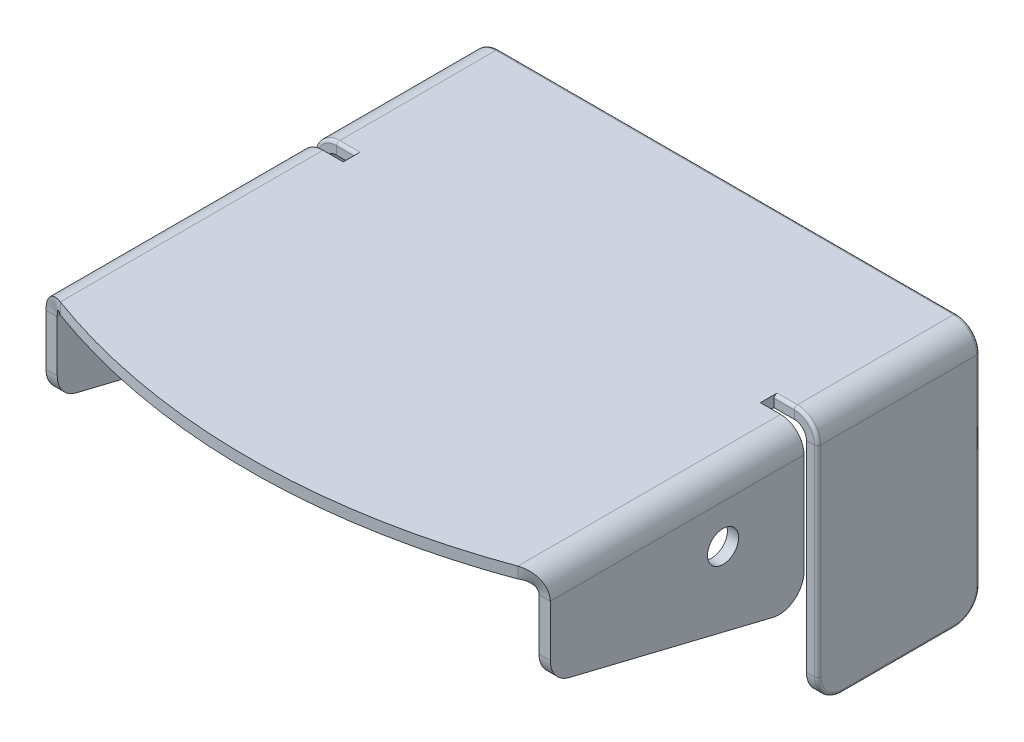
ISO-10303-21;
HEADER;
FILE_DESCRIPTION(('STEP AP214'),'2;1');
FILE_NAME('part.step','',(''),(''),'','','');
FILE_SCHEMA(('AUTOMOTIVE_DESIGN { 1 0 10303 214 1 1 1 1 }'));
ENDSEC;
DATA;
#1=APPLICATION_CONTEXT('core data for automotive mechanical design processes');
#2=APPLICATION_PROTOCOL_DEFINITION('international standard','automotive_design',2000,#1);
#3=PRODUCT_CONTEXT('',#1,'mechanical');
#4=PRODUCT('Part','Part','',(#3));
#5=PRODUCT_RELATED_PRODUCT_CATEGORY('part','',(#4));
#6=PRODUCT_DEFINITION_FORMATION('','',#4);
#7=PRODUCT_DEFINITION_CONTEXT('part definition',#1,'design');
#8=PRODUCT_DEFINITION('design','',#6,#7);
#9=PRODUCT_DEFINITION_SHAPE('','',#8);
#10=(LENGTH_UNIT() NAMED_UNIT(*) SI_UNIT(.MILLI.,.METRE.));
#11=(NAMED_UNIT(*) PLANE_ANGLE_UNIT() SI_UNIT($,.RADIAN.));
#12=(NAMED_UNIT(*) SI_UNIT($,.STERADIAN.) SOLID_ANGLE_UNIT());
#13=UNCERTAINTY_MEASURE_WITH_UNIT(LENGTH_MEASURE(1.E-05),#10,'distance_accuracy_value','');
#14=(GEOMETRIC_REPRESENTATION_CONTEXT(3) GLOBAL_UNCERTAINTY_ASSIGNED_CONTEXT((#13)) GLOBAL_UNIT_ASSIGNED_CONTEXT((#10,
#11,#12)) REPRESENTATION_CONTEXT('',''));
#15=CARTESIAN_POINT('',(0.,0.,0.));
#16=DIRECTION('',(0.,0.,1.));
#17=DIRECTION('',(1.,0.,0.));
#18=AXIS2_PLACEMENT_3D('',#15,#16,#17);
#19=CARTESIAN_POINT('',(-40.5,0.,77.));
#20=DIRECTION('',(-1.,0.,0.));
#21=DIRECTION('',(0.,-1.,0.));
#22=AXIS2_PLACEMENT_3D('',#19,#20,#21);
#23=PLANE('',#22);
#24=CARTESIAN_POINT('',(-40.5,-10.,41.25));
#25=DIRECTION('',(1.,0.,0.));
#26=DIRECTION('',(0.,0.,-1.));
#27=AXIS2_PLACEMENT_3D('',#24,#25,#26);
#28=CIRCLE('',#27,2.5);
#29=CARTESIAN_POINT('',(-40.5,-10.,38.75));
#30=VERTEX_POINT('',#29);
#31=EDGE_CURVE('E526',#30,#30,#28,.T.);
#32=ORIENTED_EDGE('',*,*,#31,.T.);
#33=EDGE_LOOP('',(#32));
#34=FACE_BOUND('',#33,.T.);
#35=DIRECTION('',(0.,-0.237297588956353,-0.97143700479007));
#36=VECTOR('',#35,1.);
#37=CARTESIAN_POINT('',(-40.5,-30.1938041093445,7.3755857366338));
#38=LINE('',#37,#36);
#39=CARTESIAN_POINT('',(-40.5,-15.8857480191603,65.9491903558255));
#40=VERTEX_POINT('',#39);
#41=CARTESIAN_POINT('',(-40.5,-23.8857480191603,33.1991903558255));
#42=VERTEX_POINT('',#41);
#43=EDGE_CURVE('E338',#40,#42,#38,.T.);
#44=ORIENTED_EDGE('',*,*,#43,.F.);
#45=CARTESIAN_POINT('',(-40.5,-12.,65.));
#46=DIRECTION('',(1.,0.,0.));
#47=DIRECTION('',(0.,0.,-1.));
#48=AXIS2_PLACEMENT_3D('',#45,#46,#47);
#49=CIRCLE('',#48,3.99999999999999);
#50=CARTESIAN_POINT('',(-40.5,-12.,69.));
#51=VERTEX_POINT('',#50);
#52=EDGE_CURVE('E332',#51,#40,#49,.T.);
#53=ORIENTED_EDGE('',*,*,#52,.F.);
#54=DIRECTION('',(0.,1.,0.));
#55=VECTOR('',#54,1.);
#56=CARTESIAN_POINT('',(-40.5,-40.,69.));
#57=LINE('',#56,#55);
#58=CARTESIAN_POINT('',(-40.5,-3.75,69.));
#59=VERTEX_POINT('',#58);
#60=EDGE_CURVE('E343',#51,#59,#57,.T.);
#61=ORIENTED_EDGE('',*,*,#60,.T.);
#62=DIRECTION('',(0.,0.,-1.));
#63=VECTOR('',#62,1.);
#64=CARTESIAN_POINT('',(-40.5,-3.75,77.));
#65=LINE('',#64,#63);
#66=CARTESIAN_POINT('',(-40.5,-3.75,28.25));
#67=VERTEX_POINT('',#66);
#68=EDGE_CURVE('E554',#59,#67,#65,.T.);
#69=ORIENTED_EDGE('',*,*,#68,.T.);
#70=DIRECTION('',(0.,1.,0.));
#71=VECTOR('',#70,1.);
#72=CARTESIAN_POINT('',(-40.5,-40.001,28.25));
#73=LINE('',#72,#71);
#74=CARTESIAN_POINT('',(-40.5,-20.,28.25));
#75=VERTEX_POINT('',#74);
#76=EDGE_CURVE('E383',#75,#67,#73,.T.);
#77=ORIENTED_EDGE('',*,*,#76,.F.);
#78=CARTESIAN_POINT('',(-40.5,-20.,32.25));
#79=DIRECTION('',(1.,0.,0.));
#80=DIRECTION('',(0.,0.,-1.));
#81=AXIS2_PLACEMENT_3D('',#78,#79,#80);
#82=CIRCLE('',#81,4.);
#83=EDGE_CURVE('E346',#42,#75,#82,.T.);
#84=ORIENTED_EDGE('',*,*,#83,.F.);
#85=EDGE_LOOP('',(#44,#53,#61,#69,#77,#84));
#86=FACE_BOUND('',#85,.T.);
#87=ADVANCED_FACE('F41',(#34,#86),#23,.T.);
#88=CARTESIAN_POINT('',(-38.7,0.,77.));
#89=DIRECTION('',(-1.,0.,0.));
#90=DIRECTION('',(0.,-1.,0.));
#91=AXIS2_PLACEMENT_3D('',#88,#89,#90);
#92=PLANE('',#91);
#93=CARTESIAN_POINT('',(-38.7,-10.,41.25));
#94=DIRECTION('',(1.,0.,0.));
#95=DIRECTION('',(0.,0.,-1.));
#96=AXIS2_PLACEMENT_3D('',#93,#94,#95);
#97=CIRCLE('',#96,2.5);
#98=CARTESIAN_POINT('',(-38.7,-10.,38.75));
#99=VERTEX_POINT('',#98);
#100=EDGE_CURVE('E520',#99,#99,#97,.T.);
#101=ORIENTED_EDGE('',*,*,#100,.F.);
#102=EDGE_LOOP('',(#101));
#103=FACE_BOUND('',#102,.T.);
#104=CARTESIAN_POINT('',(-38.7,-12.,65.));
#105=DIRECTION('',(1.,0.,0.));
#106=DIRECTION('',(0.,0.,-1.));
#107=AXIS2_PLACEMENT_3D('',#104,#105,#106);
#108=CIRCLE('',#107,3.99999999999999);
#109=CARTESIAN_POINT('',(-38.7,-12.,69.));
#110=VERTEX_POINT('',#109);
#111=CARTESIAN_POINT('',(-38.7,-15.8857480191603,65.9491903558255));
#112=VERTEX_POINT('',#111);
#113=EDGE_CURVE('E58',#110,#112,#108,.T.);
#114=ORIENTED_EDGE('',*,*,#113,.T.);
#115=DIRECTION('',(0.,-0.237297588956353,-0.97143700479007));
#116=VECTOR('',#115,1.);
#117=CARTESIAN_POINT('',(-38.7,-30.1938041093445,7.3755857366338));
#118=LINE('',#117,#116);
#119=CARTESIAN_POINT('',(-38.7,-23.8857480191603,33.1991903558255));
#120=VERTEX_POINT('',#119);
#121=EDGE_CURVE('E347',#112,#120,#118,.T.);
#122=ORIENTED_EDGE('',*,*,#121,.T.);
#123=CARTESIAN_POINT('',(-38.7,-20.,32.25));
#124=DIRECTION('',(1.,0.,0.));
#125=DIRECTION('',(0.,0.,-1.));
#126=AXIS2_PLACEMENT_3D('',#123,#124,#125);
#127=CIRCLE('',#126,4.);
#128=CARTESIAN_POINT('',(-38.7,-20.,28.25));
#129=VERTEX_POINT('',#128);
#130=EDGE_CURVE('E540',#120,#129,#127,.T.);
#131=ORIENTED_EDGE('',*,*,#130,.T.);
#132=DIRECTION('',(0.,1.,0.));
#133=VECTOR('',#132,1.);
#134=CARTESIAN_POINT('',(-38.7,-40.001,28.25));
#135=LINE('',#134,#133);
#136=CARTESIAN_POINT('',(-38.7,-3.75,28.25));
#137=VERTEX_POINT('',#136);
#138=EDGE_CURVE('E393',#129,#137,#135,.T.);
#139=ORIENTED_EDGE('',*,*,#138,.T.);
#140=DIRECTION('',(0.,0.,-1.));
#141=VECTOR('',#140,1.);
#142=CARTESIAN_POINT('',(-38.7,-3.75,77.));
#143=LINE('',#142,#141);
#144=CARTESIAN_POINT('',(-38.7,-3.75,69.));
#145=VERTEX_POINT('',#144);
#146=EDGE_CURVE('E790',#145,#137,#143,.T.);
#147=ORIENTED_EDGE('',*,*,#146,.F.);
#148=DIRECTION('',(0.,-1.,0.));
#149=VECTOR('',#148,1.);
#150=CARTESIAN_POINT('',(-38.7,0.,69.));
#151=LINE('',#150,#149);
#152=EDGE_CURVE('E353',#110,#145,#151,.F.);
#153=ORIENTED_EDGE('',*,*,#152,.F.);
#154=EDGE_LOOP('',(#114,#122,#131,#139,#147,#153));
#155=FACE_BOUND('',#154,.T.);
#156=ADVANCED_FACE('F491',(#103,#155),#92,.F.);
#157=CARTESIAN_POINT('',(-40.5,-40.,69.));
#158=DIRECTION('',(0.,0.,1.));
#159=DIRECTION('',(0.,1.,0.));
#160=AXIS2_PLACEMENT_3D('',#157,#158,#159);
#161=PLANE('',#160);
#162=ORIENTED_EDGE('',*,*,#60,.F.);
#163=DIRECTION('',(1.,0.,0.));
#164=VECTOR('',#163,1.);
#165=CARTESIAN_POINT('',(-40.5,-12.,69.));
#166=LINE('',#165,#164);
#167=EDGE_CURVE('E329',#51,#110,#166,.T.);
#168=ORIENTED_EDGE('',*,*,#167,.T.);
#169=ORIENTED_EDGE('',*,*,#152,.T.);
#170=DIRECTION('',(-1.,0.,0.));
#171=VECTOR('',#170,1.);
#172=CARTESIAN_POINT('',(-40.5,-3.75,69.));
#173=LINE('',#172,#171);
#174=EDGE_CURVE('E351',#59,#145,#173,.F.);
#175=ORIENTED_EDGE('',*,*,#174,.F.);
#176=EDGE_LOOP('',(#162,#168,#169,#175));
#177=FACE_BOUND('',#176,.T.);
#178=ADVANCED_FACE('F349',(#177),#161,.T.);
#179=CARTESIAN_POINT('',(-40.5,0.,77.));
#180=DIRECTION('',(0.,1.,0.));
#181=DIRECTION('',(0.,0.,1.));
#182=AXIS2_PLACEMENT_3D('',#179,#180,#181);
#183=PLANE('',#182);
#184=DIRECTION('',(0.,0.,-1.));
#185=VECTOR('',#184,1.);
#186=CARTESIAN_POINT('',(-36.75,0.,77.));
#187=LINE('',#186,#185);
#188=CARTESIAN_POINT('',(-36.75,0.,25.55));
#189=VERTEX_POINT('',#188);
#190=CARTESIAN_POINT('',(-36.75,0.,0.5));
#191=VERTEX_POINT('',#190);
#192=EDGE_CURVE('E557',#189,#191,#187,.T.);
#193=ORIENTED_EDGE('',*,*,#192,.F.);
#194=DIRECTION('',(1.,0.,0.));
#195=VECTOR('',#194,1.);
#196=CARTESIAN_POINT('',(-40.5,0.,25.55));
#197=LINE('',#196,#195);
#198=CARTESIAN_POINT('',(-33.5,0.,25.55));
#199=VERTEX_POINT('',#198);
#200=EDGE_CURVE('E611',#189,#199,#197,.T.);
#201=ORIENTED_EDGE('',*,*,#200,.T.);
#202=DIRECTION('',(0.,0.,1.));
#203=VECTOR('',#202,1.);
#204=CARTESIAN_POINT('',(-33.5,0.,26.05));
#205=LINE('',#204,#203);
#206=CARTESIAN_POINT('',(-33.5,0.,28.25));
#207=VERTEX_POINT('',#206);
#208=EDGE_CURVE('E380',#199,#207,#205,.T.);
#209=ORIENTED_EDGE('',*,*,#208,.T.);
#210=DIRECTION('',(-1.,0.,0.));
#211=VECTOR('',#210,1.);
#212=CARTESIAN_POINT('',(-40.5,0.,28.25));
#213=LINE('',#212,#211);
#214=CARTESIAN_POINT('',(-36.75,0.,28.25));
#215=VERTEX_POINT('',#214);
#216=EDGE_CURVE('E377',#207,#215,#213,.T.);
#217=ORIENTED_EDGE('',*,*,#216,.T.);
#218=CARTESIAN_POINT('',(-36.75,0.,70.459451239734));
#219=VERTEX_POINT('',#218);
#220=EDGE_CURVE('E567',#219,#215,#187,.T.);
#221=ORIENTED_EDGE('',*,*,#220,.F.);
#222=CARTESIAN_POINT('',(0.,0.,-29.5156249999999));
#223=DIRECTION('',(0.,1.,0.));
#224=DIRECTION('',(0.,0.,1.));
#225=AXIS2_PLACEMENT_3D('',#222,#223,#224);
#226=CIRCLE('',#225,106.515625);
#227=CARTESIAN_POINT('',(36.75,0.,70.459451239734));
#228=VERTEX_POINT('',#227);
#229=EDGE_CURVE('E1053',#228,#219,#226,.F.);
#230=ORIENTED_EDGE('',*,*,#229,.F.);
#231=DIRECTION('',(0.,0.,-1.));
#232=VECTOR('',#231,1.);
#233=CARTESIAN_POINT('',(36.75,0.,77.));
#234=LINE('',#233,#232);
#235=CARTESIAN_POINT('',(36.75,0.,28.25));
#236=VERTEX_POINT('',#235);
#237=EDGE_CURVE('E796',#228,#236,#234,.T.);
#238=ORIENTED_EDGE('',*,*,#237,.T.);
#239=DIRECTION('',(1.,0.,0.));
#240=VECTOR('',#239,1.);
#241=CARTESIAN_POINT('',(40.5,0.,28.25));
#242=LINE('',#241,#240);
#243=CARTESIAN_POINT('',(33.5,0.,28.25));
#244=VERTEX_POINT('',#243);
#245=EDGE_CURVE('E747',#244,#236,#242,.T.);
#246=ORIENTED_EDGE('',*,*,#245,.F.);
#247=DIRECTION('',(0.,0.,1.));
#248=VECTOR('',#247,1.);
#249=CARTESIAN_POINT('',(33.5,0.,26.05));
#250=LINE('',#249,#248);
#251=CARTESIAN_POINT('',(33.5,0.,25.55));
#252=VERTEX_POINT('',#251);
#253=EDGE_CURVE('E752',#252,#244,#250,.T.);
#254=ORIENTED_EDGE('',*,*,#253,.F.);
#255=DIRECTION('',(-1.,0.,0.));
#256=VECTOR('',#255,1.);
#257=CARTESIAN_POINT('',(36.75,0.,25.55));
#258=LINE('',#257,#256);
#259=CARTESIAN_POINT('',(36.75,0.,25.55));
#260=VERTEX_POINT('',#259);
#261=EDGE_CURVE('E609',#252,#260,#258,.F.);
#262=ORIENTED_EDGE('',*,*,#261,.T.);
#263=CARTESIAN_POINT('',(36.75,0.,0.5));
#264=VERTEX_POINT('',#263);
#265=EDGE_CURVE('E571',#260,#264,#234,.T.);
#266=ORIENTED_EDGE('',*,*,#265,.T.);
#267=DIRECTION('',(1.,0.,0.));
#268=VECTOR('',#267,1.);
#269=CARTESIAN_POINT('',(-40.5,0.,0.5));
#270=LINE('',#269,#268);
#271=EDGE_CURVE('E607',#264,#191,#270,.F.);
#272=ORIENTED_EDGE('',*,*,#271,.T.);
#273=EDGE_LOOP('',(#193,#201,#209,#217,#221,#230,#238,#246,#254,#262,#266,#272));
#274=FACE_BOUND('',#273,.T.);
#275=ADVANCED_FACE('F490',(#274),#183,.T.);
#276=CARTESIAN_POINT('',(-40.5,-1.8,77.));
#277=DIRECTION('',(0.,1.,0.));
#278=DIRECTION('',(0.,0.,1.));
#279=AXIS2_PLACEMENT_3D('',#276,#277,#278);
#280=PLANE('',#279);
#281=CARTESIAN_POINT('',(0.,-1.8,-29.5156249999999));
#282=DIRECTION('',(0.,1.,0.));
#283=DIRECTION('',(0.,0.,1.));
#284=AXIS2_PLACEMENT_3D('',#281,#282,#283);
#285=CIRCLE('',#284,106.515625);
#286=CARTESIAN_POINT('',(36.75,-1.8,70.459451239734));
#287=VERTEX_POINT('',#286);
#288=CARTESIAN_POINT('',(-36.75,-1.8,70.459451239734));
#289=VERTEX_POINT('',#288);
#290=EDGE_CURVE('E440',#287,#289,#285,.F.);
#291=ORIENTED_EDGE('',*,*,#290,.T.);
#292=DIRECTION('',(0.,0.,-1.));
#293=VECTOR('',#292,1.);
#294=CARTESIAN_POINT('',(-36.75,-1.8,77.));
#295=LINE('',#294,#293);
#296=CARTESIAN_POINT('',(-36.75,-1.8,28.25));
#297=VERTEX_POINT('',#296);
#298=EDGE_CURVE('E787',#289,#297,#295,.T.);
#299=ORIENTED_EDGE('',*,*,#298,.T.);
#300=DIRECTION('',(1.,0.,0.));
#301=VECTOR('',#300,1.);
#302=CARTESIAN_POINT('',(-40.5,-1.8,28.25));
#303=LINE('',#302,#301);
#304=CARTESIAN_POINT('',(-33.5,-1.8,28.25));
#305=VERTEX_POINT('',#304);
#306=EDGE_CURVE('E395',#297,#305,#303,.T.);
#307=ORIENTED_EDGE('',*,*,#306,.T.);
#308=DIRECTION('',(0.,0.,-1.));
#309=VECTOR('',#308,1.);
#310=CARTESIAN_POINT('',(-33.5,-1.8,26.05));
#311=LINE('',#310,#309);
#312=CARTESIAN_POINT('',(-33.5,-1.8,26.05));
#313=VERTEX_POINT('',#312);
#314=EDGE_CURVE('E371',#305,#313,#311,.T.);
#315=ORIENTED_EDGE('',*,*,#314,.T.);
#316=DIRECTION('',(-1.,0.,0.));
#317=VECTOR('',#316,1.);
#318=CARTESIAN_POINT('',(-40.5,-1.8,26.05));
#319=LINE('',#318,#317);
#320=CARTESIAN_POINT('',(-36.75,-1.8,26.05));
#321=VERTEX_POINT('',#320);
#322=EDGE_CURVE('E374',#313,#321,#319,.T.);
#323=ORIENTED_EDGE('',*,*,#322,.T.);
#324=CARTESIAN_POINT('',(-36.75,-1.8,0.));
#325=VERTEX_POINT('',#324);
#326=EDGE_CURVE('E786',#321,#325,#295,.T.);
#327=ORIENTED_EDGE('',*,*,#326,.T.);
#328=DIRECTION('',(1.,0.,0.));
#329=VECTOR('',#328,1.);
#330=CARTESIAN_POINT('',(-40.5,-1.8,0.));
#331=LINE('',#330,#329);
#332=CARTESIAN_POINT('',(36.75,-1.8,0.));
#333=VERTEX_POINT('',#332);
#334=EDGE_CURVE('E773',#325,#333,#331,.T.);
#335=ORIENTED_EDGE('',*,*,#334,.T.);
#336=DIRECTION('',(0.,0.,-1.));
#337=VECTOR('',#336,1.);
#338=CARTESIAN_POINT('',(36.75,-1.8,77.));
#339=LINE('',#338,#337);
#340=CARTESIAN_POINT('',(36.75,-1.8,26.05));
#341=VERTEX_POINT('',#340);
#342=EDGE_CURVE('E783',#341,#333,#339,.T.);
#343=ORIENTED_EDGE('',*,*,#342,.F.);
#344=DIRECTION('',(1.,0.,0.));
#345=VECTOR('',#344,1.);
#346=CARTESIAN_POINT('',(40.5,-1.8,26.05));
#347=LINE('',#346,#345);
#348=CARTESIAN_POINT('',(33.5,-1.8,26.05));
#349=VERTEX_POINT('',#348);
#350=EDGE_CURVE('E759',#349,#341,#347,.T.);
#351=ORIENTED_EDGE('',*,*,#350,.F.);
#352=DIRECTION('',(0.,0.,-1.));
#353=VECTOR('',#352,1.);
#354=CARTESIAN_POINT('',(33.5,-1.8,26.05));
#355=LINE('',#354,#353);
#356=CARTESIAN_POINT('',(33.5,-1.8,28.25));
#357=VERTEX_POINT('',#356);
#358=EDGE_CURVE('E744',#357,#349,#355,.T.);
#359=ORIENTED_EDGE('',*,*,#358,.F.);
#360=DIRECTION('',(-1.,0.,0.));
#361=VECTOR('',#360,1.);
#362=CARTESIAN_POINT('',(40.5,-1.8,28.25));
#363=LINE('',#362,#361);
#364=CARTESIAN_POINT('',(36.75,-1.8,28.25));
#365=VERTEX_POINT('',#364);
#366=EDGE_CURVE('E1011',#365,#357,#363,.T.);
#367=ORIENTED_EDGE('',*,*,#366,.F.);
#368=EDGE_CURVE('E784',#287,#365,#339,.T.);
#369=ORIENTED_EDGE('',*,*,#368,.F.);
#370=EDGE_LOOP('',(#291,#299,#307,#315,#323,#327,#335,#343,#351,#359,#367,#369));
#371=FACE_BOUND('',#370,.T.);
#372=ADVANCED_FACE('F926',(#371),#280,.F.);
#373=CARTESIAN_POINT('',(-36.75,-3.75,77.));
#374=DIRECTION('',(0.,0.,-1.));
#375=DIRECTION('',(-1.,0.,0.));
#376=AXIS2_PLACEMENT_3D('',#373,#374,#375);
#377=CYLINDRICAL_SURFACE('',#376,3.75);
#378=ORIENTED_EDGE('',*,*,#68,.F.);
#379=CARTESIAN_POINT('',(-40.5,-3.75,69.));
#380=CARTESIAN_POINT('',(-40.5000138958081,-3.65183678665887,68.9999811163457));
#381=CARTESIAN_POINT('',(-40.4961461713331,-3.55367833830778,69.0015677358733));
#382=CARTESIAN_POINT('',(-40.4807502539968,-3.35808713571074,69.0078947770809));
#383=CARTESIAN_POINT('',(-40.4692237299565,-3.26065422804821,69.0126345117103));
#384=CARTESIAN_POINT('',(-40.4386543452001,-3.06744882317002,69.0251935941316));
#385=CARTESIAN_POINT('',(-40.4196319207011,-2.97167254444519,69.0330045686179));
#386=CARTESIAN_POINT('',(-40.3742648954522,-2.78216903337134,69.0516266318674));
#387=CARTESIAN_POINT('',(-40.3479200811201,-2.68844186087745,69.0624378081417));
#388=CARTESIAN_POINT('',(-40.2880602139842,-2.50335856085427,69.0869123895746));
#389=CARTESIAN_POINT('',(-40.2545231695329,-2.41201069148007,69.1005845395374));
#390=CARTESIAN_POINT('',(-40.1806450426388,-2.23256606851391,69.1306805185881));
#391=CARTESIAN_POINT('',(-40.1403015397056,-2.14447048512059,69.1471053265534));
#392=CARTESIAN_POINT('',(-40.0095642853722,-1.88587041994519,69.2002292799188));
#393=CARTESIAN_POINT('',(-39.9094302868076,-1.72095002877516,69.240791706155));
#394=CARTESIAN_POINT('',(-39.6814723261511,-1.40286597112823,69.3326198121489));
#395=CARTESIAN_POINT('',(-39.5525934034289,-1.25058208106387,69.3842894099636));
#396=CARTESIAN_POINT('',(-39.274069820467,-0.969582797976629,69.4952264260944));
#397=CARTESIAN_POINT('',(-39.1244187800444,-0.840874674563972,69.5544961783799));
#398=CARTESIAN_POINT('',(-38.7973481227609,-0.601224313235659,69.6830554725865));
#399=CARTESIAN_POINT('',(-38.6187182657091,-0.492154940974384,69.7527559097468));
#400=CARTESIAN_POINT('',(-38.2472590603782,-0.305591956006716,69.8964651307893));
#401=CARTESIAN_POINT('',(-38.0544255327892,-0.228107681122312,69.9704751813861));
#402=CARTESIAN_POINT('',(-37.6775622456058,-0.111683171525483,70.1137759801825));
#403=CARTESIAN_POINT('',(-37.4943511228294,-0.0698559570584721,70.1828756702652));
#404=CARTESIAN_POINT('',(-37.2167152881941,-0.0279782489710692,70.2866993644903));
#405=CARTESIAN_POINT('',(-37.1237253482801,-0.0174962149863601,70.3213270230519));
#406=CARTESIAN_POINT('',(-36.9371832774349,-0.00350776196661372,70.390494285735));
#407=CARTESIAN_POINT('',(-36.8436311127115,-1.76651606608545E-06,70.4250338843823));
#408=CARTESIAN_POINT('',(-36.75,0.,70.459451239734));
#409=B_SPLINE_CURVE_WITH_KNOTS('',3,(#379,#380,#381,#382,#383,#384,#385,#386,#387,#388,#389,
#390,#391,#392,#393,#394,#395,#396,#397,#398,#399,#400,#401,#402,#403,#404,#405,#406,#407,#408),
.UNSPECIFIED.,.F.,.F.,(4,2,2,2,2,2,2,2,2,2,2,2,2,2,4),(0.,0.294392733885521,0.588721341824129,
0.882253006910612,1.17579323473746,1.47024415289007,1.7648000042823,2.35358914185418,
2.96924334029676,3.58508705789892,4.24401546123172,4.90313852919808,5.50171030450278,
5.80083654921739,6.09998095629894),.UNSPECIFIED.);
#410=EDGE_CURVE('E514',#59,#219,#409,.T.);
#411=ORIENTED_EDGE('',*,*,#410,.T.);
#412=ORIENTED_EDGE('',*,*,#220,.T.);
#413=CARTESIAN_POINT('',(-36.75,-3.75,28.25));
#414=DIRECTION('',(0.,0.,-1.));
#415=DIRECTION('',(0.,1.,0.));
#416=AXIS2_PLACEMENT_3D('',#413,#414,#415);
#417=CIRCLE('',#416,3.75);
#418=EDGE_CURVE('E362',#67,#215,#417,.T.);
#419=ORIENTED_EDGE('',*,*,#418,.F.);
#420=EDGE_LOOP('',(#378,#411,#412,#419));
#421=FACE_BOUND('',#420,.T.);
#422=ADVANCED_FACE('F566',(#421),#377,.T.);
#423=CARTESIAN_POINT('',(-36.75,-3.75,77.));
#424=DIRECTION('',(0.,0.,-1.));
#425=DIRECTION('',(-1.,0.,0.));
#426=AXIS2_PLACEMENT_3D('',#423,#424,#425);
#427=CYLINDRICAL_SURFACE('',#426,1.95);
#428=CARTESIAN_POINT('',(-38.7,-3.75,69.));
#429=CARTESIAN_POINT('',(-38.7000094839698,-3.70378914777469,68.9999813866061));
#430=CARTESIAN_POINT('',(-38.6983576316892,-3.65758519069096,69.0012839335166));
#431=CARTESIAN_POINT('',(-38.691804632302,-3.56557989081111,69.0064613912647));
#432=CARTESIAN_POINT('',(-38.686905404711,-3.51977832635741,69.0103347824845));
#433=CARTESIAN_POINT('',(-38.6739712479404,-3.42919396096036,69.0205522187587));
#434=CARTESIAN_POINT('',(-38.6659560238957,-3.38440659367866,69.0268807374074));
#435=CARTESIAN_POINT('',(-38.6469278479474,-3.2958882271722,69.0419111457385));
#436=CARTESIAN_POINT('',(-38.6359145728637,-3.25215734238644,69.0506132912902));
#437=CARTESIAN_POINT('',(-38.5986568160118,-3.12314478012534,69.0799672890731));
#438=CARTESIAN_POINT('',(-38.5681559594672,-3.03978246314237,69.103897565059));
#439=CARTESIAN_POINT('',(-38.4973600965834,-2.87999750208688,69.1593117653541));
#440=CARTESIAN_POINT('',(-38.4570507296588,-2.80358526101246,69.1908067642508));
#441=CARTESIAN_POINT('',(-38.3643657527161,-2.65233855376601,69.2629281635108));
#442=CARTESIAN_POINT('',(-38.3112410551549,-2.57823289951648,69.3041138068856));
#443=CARTESIAN_POINT('',(-38.19724045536,-2.44002597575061,69.3920262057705));
#444=CARTESIAN_POINT('',(-38.1363625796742,-2.37592726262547,69.4387543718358));
#445=CARTESIAN_POINT('',(-37.9952461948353,-2.24571270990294,69.5464566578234));
#446=CARTESIAN_POINT('',(-37.9136038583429,-2.18190590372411,69.608381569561));
#447=CARTESIAN_POINT('',(-37.7435872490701,-2.06901321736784,69.7363572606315));
#448=CARTESIAN_POINT('',(-37.6552052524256,-2.01994455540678,69.8024127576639));
#449=CARTESIAN_POINT('',(-37.4552159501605,-1.92802047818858,69.950685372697));
#450=CARTESIAN_POINT('',(-37.3425262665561,-1.88842816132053,70.0334694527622));
#451=CARTESIAN_POINT('',(-37.1129933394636,-1.83043678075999,70.2003558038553));
#452=CARTESIAN_POINT('',(-36.9961560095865,-1.81200870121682,70.2844561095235));
#453=CARTESIAN_POINT('',(-36.8357684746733,-1.80141646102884,70.398704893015));
#454=CARTESIAN_POINT('',(-36.7929037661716,-1.80000119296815,70.4291232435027));
#455=CARTESIAN_POINT('',(-36.75,-1.8,70.459451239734));
#456=B_SPLINE_CURVE_WITH_KNOTS('',3,(#428,#429,#430,#431,#432,#433,#434,#435,#436,#437,#438,
#439,#440,#441,#442,#443,#444,#445,#446,#447,#448,#449,#450,#451,#452,#453,#454,#455),
.UNSPECIFIED.,.F.,.F.,(4,2,2,2,2,2,2,2,2,2,2,2,2,4),(0.,0.138572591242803,0.277063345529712,
0.414692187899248,0.55233587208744,0.826837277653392,1.10174302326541,1.40080809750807,
1.69994944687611,2.06076868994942,2.42200784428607,2.85629808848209,3.28999221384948,
3.4476504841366),.UNSPECIFIED.);
#457=EDGE_CURVE('E358',#145,#289,#456,.T.);
#458=ORIENTED_EDGE('',*,*,#457,.F.);
#459=ORIENTED_EDGE('',*,*,#146,.T.);
#460=CARTESIAN_POINT('',(-36.75,-3.75,28.25));
#461=DIRECTION('',(0.,0.,-1.));
#462=DIRECTION('',(0.,1.,0.));
#463=AXIS2_PLACEMENT_3D('',#460,#461,#462);
#464=CIRCLE('',#463,1.95);
#465=EDGE_CURVE('E387',#137,#297,#464,.T.);
#466=ORIENTED_EDGE('',*,*,#465,.T.);
#467=ORIENTED_EDGE('',*,*,#298,.F.);
#468=EDGE_LOOP('',(#458,#459,#466,#467));
#469=FACE_BOUND('',#468,.T.);
#470=ADVANCED_FACE('F925',(#469),#427,.F.);
#471=CARTESIAN_POINT('',(-40.5,-40.001,28.25));
#472=DIRECTION('',(0.,0.,-1.));
#473=DIRECTION('',(0.,1.,0.));
#474=AXIS2_PLACEMENT_3D('',#471,#472,#473);
#475=PLANE('',#474);
#476=ORIENTED_EDGE('',*,*,#306,.F.);
#477=DIRECTION('',(0.,1.,0.));
#478=VECTOR('',#477,1.);
#479=CARTESIAN_POINT('',(-36.75,-1.8,28.25));
#480=LINE('',#479,#478);
#481=EDGE_CURVE('E563',#297,#215,#480,.T.);
#482=ORIENTED_EDGE('',*,*,#481,.T.);
#483=ORIENTED_EDGE('',*,*,#216,.F.);
#484=DIRECTION('',(0.,1.,0.));
#485=VECTOR('',#484,1.);
#486=CARTESIAN_POINT('',(-33.5,-40.001,28.25));
#487=LINE('',#486,#485);
#488=EDGE_CURVE('E388',#305,#207,#487,.T.);
#489=ORIENTED_EDGE('',*,*,#488,.F.);
#490=EDGE_LOOP('',(#476,#482,#483,#489));
#491=FACE_BOUND('',#490,.T.);
#492=ADVANCED_FACE('F478',(#491),#475,.T.);
#493=DIRECTION('',(1.,0.,0.));
#494=VECTOR('',#493,1.);
#495=CARTESIAN_POINT('',(-40.5,-20.,28.25));
#496=LINE('',#495,#494);
#497=EDGE_CURVE('E337',#75,#129,#496,.T.);
#498=ORIENTED_EDGE('',*,*,#497,.F.);
#499=ORIENTED_EDGE('',*,*,#76,.T.);
#500=DIRECTION('',(1.,0.,0.));
#501=VECTOR('',#500,1.);
#502=CARTESIAN_POINT('',(-40.5,-3.75,28.25));
#503=LINE('',#502,#501);
#504=EDGE_CURVE('E561',#67,#137,#503,.T.);
#505=ORIENTED_EDGE('',*,*,#504,.T.);
#506=ORIENTED_EDGE('',*,*,#138,.F.);
#507=EDGE_LOOP('',(#498,#499,#505,#506));
#508=FACE_BOUND('',#507,.T.);
#509=ADVANCED_FACE('F479',(#508),#475,.T.);
#510=CARTESIAN_POINT('',(-40.5,-40.001,26.05));
#511=DIRECTION('',(0.,0.,1.));
#512=DIRECTION('',(0.,-1.,0.));
#513=AXIS2_PLACEMENT_3D('',#510,#511,#512);
#514=PLANE('',#513);
#515=DIRECTION('',(-1.,0.,0.));
#516=VECTOR('',#515,1.);
#517=CARTESIAN_POINT('',(-38.7,-3.75,26.05));
#518=LINE('',#517,#516);
#519=CARTESIAN_POINT('',(-38.7,-3.75,26.05));
#520=VERTEX_POINT('',#519);
#521=CARTESIAN_POINT('',(-40.,-3.75,26.05));
#522=VERTEX_POINT('',#521);
#523=EDGE_CURVE('E564',#520,#522,#518,.T.);
#524=ORIENTED_EDGE('',*,*,#523,.T.);
#525=DIRECTION('',(0.,1.,0.));
#526=VECTOR('',#525,1.);
#527=CARTESIAN_POINT('',(-40.,-40.001,26.05));
#528=LINE('',#527,#526);
#529=CARTESIAN_POINT('',(-40.,-36.,26.05));
#530=VERTEX_POINT('',#529);
#531=EDGE_CURVE('E632',#522,#530,#528,.F.);
#532=ORIENTED_EDGE('',*,*,#531,.T.);
#533=DIRECTION('',(1.,0.,0.));
#534=VECTOR('',#533,1.);
#535=CARTESIAN_POINT('',(-40.5,-36.,26.05));
#536=LINE('',#535,#534);
#537=CARTESIAN_POINT('',(-38.7,-36.,26.05));
#538=VERTEX_POINT('',#537);
#539=EDGE_CURVE('E591',#530,#538,#536,.T.);
#540=ORIENTED_EDGE('',*,*,#539,.T.);
#541=DIRECTION('',(0.,-1.,0.));
#542=VECTOR('',#541,1.);
#543=CARTESIAN_POINT('',(-38.7,-40.001,26.05));
#544=LINE('',#543,#542);
#545=EDGE_CURVE('E368',#520,#538,#544,.T.);
#546=ORIENTED_EDGE('',*,*,#545,.F.);
#547=EDGE_LOOP('',(#524,#532,#540,#546));
#548=FACE_BOUND('',#547,.T.);
#549=ADVANCED_FACE('F486',(#548),#514,.T.);
#550=DIRECTION('',(0.,1.,0.));
#551=VECTOR('',#550,1.);
#552=CARTESIAN_POINT('',(-33.5,-40.001,26.05));
#553=LINE('',#552,#551);
#554=CARTESIAN_POINT('',(-33.5,-0.5,26.05));
#555=VERTEX_POINT('',#554);
#556=EDGE_CURVE('E384',#313,#555,#553,.T.);
#557=ORIENTED_EDGE('',*,*,#556,.T.);
#558=DIRECTION('',(1.,0.,0.));
#559=VECTOR('',#558,1.);
#560=CARTESIAN_POINT('',(-40.5,-0.5,26.05));
#561=LINE('',#560,#559);
#562=CARTESIAN_POINT('',(-36.75,-0.5,26.05));
#563=VERTEX_POINT('',#562);
#564=EDGE_CURVE('E614',#555,#563,#561,.F.);
#565=ORIENTED_EDGE('',*,*,#564,.T.);
#566=DIRECTION('',(0.,-1.,0.));
#567=VECTOR('',#566,1.);
#568=CARTESIAN_POINT('',(-36.75,0.,26.05));
#569=LINE('',#568,#567);
#570=EDGE_CURVE('E824',#563,#321,#569,.T.);
#571=ORIENTED_EDGE('',*,*,#570,.T.);
#572=ORIENTED_EDGE('',*,*,#322,.F.);
#573=EDGE_LOOP('',(#557,#565,#571,#572));
#574=FACE_BOUND('',#573,.T.);
#575=ADVANCED_FACE('F487',(#574),#514,.T.);
#576=CARTESIAN_POINT('',(-40.5,-3.75,25.55));
#577=VERTEX_POINT('',#576);
#578=CARTESIAN_POINT('',(-40.5,-3.75,0.5));
#579=VERTEX_POINT('',#578);
#580=EDGE_CURVE('E558',#577,#579,#65,.T.);
#581=ORIENTED_EDGE('',*,*,#580,.F.);
#582=CARTESIAN_POINT('',(-36.75,-3.75,25.55));
#583=DIRECTION('',(0.,0.,1.));
#584=DIRECTION('',(0.,-1.,0.));
#585=AXIS2_PLACEMENT_3D('',#582,#583,#584);
#586=CIRCLE('',#585,3.75);
#587=EDGE_CURVE('E620',#577,#189,#586,.F.);
#588=ORIENTED_EDGE('',*,*,#587,.T.);
#589=ORIENTED_EDGE('',*,*,#192,.T.);
#590=CARTESIAN_POINT('',(-36.75,-3.75,0.5));
#591=DIRECTION('',(0.,0.,-1.));
#592=DIRECTION('',(-1.,0.,0.));
#593=AXIS2_PLACEMENT_3D('',#590,#591,#592);
#594=CIRCLE('',#593,3.75);
#595=EDGE_CURVE('E618',#191,#579,#594,.F.);
#596=ORIENTED_EDGE('',*,*,#595,.T.);
#597=EDGE_LOOP('',(#581,#588,#589,#596));
#598=FACE_BOUND('',#597,.T.);
#599=ADVANCED_FACE('F846',(#598),#377,.T.);
#600=CARTESIAN_POINT('',(-40.5,-36.,22.05));
#601=DIRECTION('',(-1.,0.,0.));
#602=DIRECTION('',(0.,-1.,0.));
#603=AXIS2_PLACEMENT_3D('',#600,#601,#602);
#604=CIRCLE('',#603,3.5);
#605=CARTESIAN_POINT('',(-40.5,-39.5,22.05));
#606=VERTEX_POINT('',#605);
#607=CARTESIAN_POINT('',(-40.5,-36.,25.55));
#608=VERTEX_POINT('',#607);
#609=EDGE_CURVE('E628',#606,#608,#604,.T.);
#610=ORIENTED_EDGE('',*,*,#609,.T.);
#611=DIRECTION('',(0.,1.,0.));
#612=VECTOR('',#611,1.);
#613=CARTESIAN_POINT('',(-40.5,0.,25.55));
#614=LINE('',#613,#612);
#615=EDGE_CURVE('E630',#608,#577,#614,.T.);
#616=ORIENTED_EDGE('',*,*,#615,.T.);
#617=ORIENTED_EDGE('',*,*,#580,.T.);
#618=DIRECTION('',(0.,1.,0.));
#619=VECTOR('',#618,1.);
#620=CARTESIAN_POINT('',(-40.5,0.,0.5));
#621=LINE('',#620,#619);
#622=CARTESIAN_POINT('',(-40.5,-36.,0.5));
#623=VERTEX_POINT('',#622);
#624=EDGE_CURVE('E622',#579,#623,#621,.F.);
#625=ORIENTED_EDGE('',*,*,#624,.T.);
#626=CARTESIAN_POINT('',(-40.5,-36.,4.));
#627=DIRECTION('',(-1.,0.,0.));
#628=DIRECTION('',(0.,-1.,0.));
#629=AXIS2_PLACEMENT_3D('',#626,#627,#628);
#630=CIRCLE('',#629,3.5);
#631=CARTESIAN_POINT('',(-40.5,-39.5,4.));
#632=VERTEX_POINT('',#631);
#633=EDGE_CURVE('E624',#623,#632,#630,.T.);
#634=ORIENTED_EDGE('',*,*,#633,.T.);
#635=DIRECTION('',(0.,0.,-1.));
#636=VECTOR('',#635,1.);
#637=CARTESIAN_POINT('',(-40.5,-39.5,77.));
#638=LINE('',#637,#636);
#639=EDGE_CURVE('E626',#632,#606,#638,.F.);
#640=ORIENTED_EDGE('',*,*,#639,.T.);
#641=EDGE_LOOP('',(#610,#616,#617,#625,#634,#640));
#642=FACE_BOUND('',#641,.T.);
#643=ADVANCED_FACE('F863',(#642),#23,.T.);
#644=CARTESIAN_POINT('',(-38.7,-40.,77.));
#645=DIRECTION('',(0.,-1.,0.));
#646=DIRECTION('',(0.,0.,-1.));
#647=AXIS2_PLACEMENT_3D('',#644,#645,#646);
#648=PLANE('',#647);
#649=DIRECTION('',(1.,0.,0.));
#650=VECTOR('',#649,1.);
#651=CARTESIAN_POINT('',(-38.7,-40.,22.05));
#652=LINE('',#651,#650);
#653=CARTESIAN_POINT('',(-38.7,-40.,22.05));
#654=VERTEX_POINT('',#653);
#655=CARTESIAN_POINT('',(-40.,-40.,22.05));
#656=VERTEX_POINT('',#655);
#657=EDGE_CURVE('E579',#654,#656,#652,.F.);
#658=ORIENTED_EDGE('',*,*,#657,.T.);
#659=DIRECTION('',(0.,0.,-1.));
#660=VECTOR('',#659,1.);
#661=CARTESIAN_POINT('',(-40.,-40.,77.));
#662=LINE('',#661,#660);
#663=CARTESIAN_POINT('',(-40.,-40.,4.));
#664=VERTEX_POINT('',#663);
#665=EDGE_CURVE('E636',#656,#664,#662,.T.);
#666=ORIENTED_EDGE('',*,*,#665,.T.);
#667=DIRECTION('',(-1.,0.,0.));
#668=VECTOR('',#667,1.);
#669=CARTESIAN_POINT('',(-38.7,-40.,4.));
#670=LINE('',#669,#668);
#671=CARTESIAN_POINT('',(-38.7,-40.,4.));
#672=VERTEX_POINT('',#671);
#673=EDGE_CURVE('E585',#664,#672,#670,.F.);
#674=ORIENTED_EDGE('',*,*,#673,.T.);
#675=DIRECTION('',(0.,0.,-1.));
#676=VECTOR('',#675,1.);
#677=CARTESIAN_POINT('',(-38.7,-40.,77.));
#678=LINE('',#677,#676);
#679=EDGE_CURVE('E793',#654,#672,#678,.T.);
#680=ORIENTED_EDGE('',*,*,#679,.F.);
#681=EDGE_LOOP('',(#658,#666,#674,#680));
#682=FACE_BOUND('',#681,.T.);
#683=ADVANCED_FACE('F878',(#682),#648,.T.);
#684=ORIENTED_EDGE('',*,*,#679,.T.);
#685=CARTESIAN_POINT('',(-38.7,-36.,4.));
#686=DIRECTION('',(-1.,0.,0.));
#687=DIRECTION('',(0.,-1.,0.));
#688=AXIS2_PLACEMENT_3D('',#685,#686,#687);
#689=CIRCLE('',#688,4.);
#690=CARTESIAN_POINT('',(-38.7,-36.,0.));
#691=VERTEX_POINT('',#690);
#692=EDGE_CURVE('E589',#672,#691,#689,.F.);
#693=ORIENTED_EDGE('',*,*,#692,.T.);
#694=DIRECTION('',(0.,1.,0.));
#695=VECTOR('',#694,1.);
#696=CARTESIAN_POINT('',(-38.7,0.,0.));
#697=LINE('',#696,#695);
#698=CARTESIAN_POINT('',(-38.7,-3.75,0.));
#699=VERTEX_POINT('',#698);
#700=EDGE_CURVE('E767',#691,#699,#697,.T.);
#701=ORIENTED_EDGE('',*,*,#700,.T.);
#702=EDGE_CURVE('E789',#520,#699,#143,.T.);
#703=ORIENTED_EDGE('',*,*,#702,.F.);
#704=ORIENTED_EDGE('',*,*,#545,.T.);
#705=CARTESIAN_POINT('',(-38.7,-36.,22.05));
#706=DIRECTION('',(-1.,0.,0.));
#707=DIRECTION('',(0.,-1.,0.));
#708=AXIS2_PLACEMENT_3D('',#705,#706,#707);
#709=CIRCLE('',#708,4.);
#710=EDGE_CURVE('E587',#538,#654,#709,.F.);
#711=ORIENTED_EDGE('',*,*,#710,.T.);
#712=EDGE_LOOP('',(#684,#693,#701,#703,#704,#711));
#713=FACE_BOUND('',#712,.T.);
#714=ADVANCED_FACE('F911',(#713),#92,.F.);
#715=CARTESIAN_POINT('',(-36.75,-3.75,26.05));
#716=DIRECTION('',(0.,0.,1.));
#717=DIRECTION('',(0.,-1.,0.));
#718=AXIS2_PLACEMENT_3D('',#715,#716,#717);
#719=CIRCLE('',#718,1.95);
#720=EDGE_CURVE('E365',#321,#520,#719,.T.);
#721=ORIENTED_EDGE('',*,*,#720,.T.);
#722=ORIENTED_EDGE('',*,*,#702,.T.);
#723=CARTESIAN_POINT('',(-36.75,-3.75,0.));
#724=DIRECTION('',(0.,0.,1.));
#725=DIRECTION('',(1.,0.,0.));
#726=AXIS2_PLACEMENT_3D('',#723,#724,#725);
#727=CIRCLE('',#726,1.95);
#728=EDGE_CURVE('E770',#699,#325,#727,.F.);
#729=ORIENTED_EDGE('',*,*,#728,.T.);
#730=ORIENTED_EDGE('',*,*,#326,.F.);
#731=EDGE_LOOP('',(#721,#722,#729,#730));
#732=FACE_BOUND('',#731,.T.);
#733=ADVANCED_FACE('F933',(#732),#427,.F.);
#734=CARTESIAN_POINT('',(38.7,0.,77.));
#735=DIRECTION('',(1.,0.,0.));
#736=DIRECTION('',(0.,1.,0.));
#737=AXIS2_PLACEMENT_3D('',#734,#735,#736);
#738=PLANE('',#737);
#739=CARTESIAN_POINT('',(38.7,-10.,41.25));
#740=DIRECTION('',(1.,0.,0.));
#741=DIRECTION('',(0.,0.,-1.));
#742=AXIS2_PLACEMENT_3D('',#739,#740,#741);
#743=CIRCLE('',#742,2.5);
#744=CARTESIAN_POINT('',(38.7,-10.,38.75));
#745=VERTEX_POINT('',#744);
#746=EDGE_CURVE('E399',#745,#745,#743,.T.);
#747=ORIENTED_EDGE('',*,*,#746,.T.);
#748=EDGE_LOOP('',(#747));
#749=FACE_BOUND('',#748,.T.);
#750=CARTESIAN_POINT('',(38.7,-20.,32.25));
#751=DIRECTION('',(1.,0.,0.));
#752=DIRECTION('',(0.,1.,0.));
#753=AXIS2_PLACEMENT_3D('',#750,#751,#752);
#754=CIRCLE('',#753,4.);
#755=CARTESIAN_POINT('',(38.7,-23.8857480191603,33.1991903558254));
#756=VERTEX_POINT('',#755);
#757=CARTESIAN_POINT('',(38.7,-20.,28.25));
#758=VERTEX_POINT('',#757);
#759=EDGE_CURVE('E409',#756,#758,#754,.T.);
#760=ORIENTED_EDGE('',*,*,#759,.F.);
#761=DIRECTION('',(0.,-0.237297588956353,-0.97143700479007));
#762=VECTOR('',#761,1.);
#763=CARTESIAN_POINT('',(38.7,-23.8857480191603,33.1991903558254));
#764=LINE('',#763,#762);
#765=CARTESIAN_POINT('',(38.7,-15.8857480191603,65.9491903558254));
#766=VERTEX_POINT('',#765);
#767=EDGE_CURVE('E417',#766,#756,#764,.T.);
#768=ORIENTED_EDGE('',*,*,#767,.F.);
#769=CARTESIAN_POINT('',(38.7,-12.,65.));
#770=DIRECTION('',(1.,0.,0.));
#771=DIRECTION('',(0.,1.,0.));
#772=AXIS2_PLACEMENT_3D('',#769,#770,#771);
#773=CIRCLE('',#772,4.);
#774=CARTESIAN_POINT('',(38.7,-12.,69.));
#775=VERTEX_POINT('',#774);
#776=EDGE_CURVE('E402',#775,#766,#773,.T.);
#777=ORIENTED_EDGE('',*,*,#776,.F.);
#778=DIRECTION('',(0.,1.,0.));
#779=VECTOR('',#778,1.);
#780=CARTESIAN_POINT('',(38.7,0.,69.));
#781=LINE('',#780,#779);
#782=CARTESIAN_POINT('',(38.7,-3.75,69.));
#783=VERTEX_POINT('',#782);
#784=EDGE_CURVE('E1044',#775,#783,#781,.T.);
#785=ORIENTED_EDGE('',*,*,#784,.T.);
#786=DIRECTION('',(0.,0.,-1.));
#787=VECTOR('',#786,1.);
#788=CARTESIAN_POINT('',(38.7,-3.75,77.));
#789=LINE('',#788,#787);
#790=CARTESIAN_POINT('',(38.7,-3.75,28.25));
#791=VERTEX_POINT('',#790);
#792=EDGE_CURVE('E780',#783,#791,#789,.T.);
#793=ORIENTED_EDGE('',*,*,#792,.T.);
#794=DIRECTION('',(0.,1.,0.));
#795=VECTOR('',#794,1.);
#796=CARTESIAN_POINT('',(38.7,-40.001,28.25));
#797=LINE('',#796,#795);
#798=EDGE_CURVE('E1014',#758,#791,#797,.T.);
#799=ORIENTED_EDGE('',*,*,#798,.F.);
#800=EDGE_LOOP('',(#760,#768,#777,#785,#793,#799));
#801=FACE_BOUND('',#800,.T.);
#802=ADVANCED_FACE('F943',(#749,#801),#738,.F.);
#803=CARTESIAN_POINT('',(40.5,0.,77.));
#804=DIRECTION('',(1.,0.,0.));
#805=DIRECTION('',(0.,1.,0.));
#806=AXIS2_PLACEMENT_3D('',#803,#804,#805);
#807=PLANE('',#806);
#808=CARTESIAN_POINT('',(40.5,-10.,41.25));
#809=DIRECTION('',(1.,0.,0.));
#810=DIRECTION('',(0.,0.,-1.));
#811=AXIS2_PLACEMENT_3D('',#808,#809,#810);
#812=CIRCLE('',#811,2.5);
#813=CARTESIAN_POINT('',(40.5,-10.,38.75));
#814=VERTEX_POINT('',#813);
#815=EDGE_CURVE('E398',#814,#814,#812,.T.);
#816=ORIENTED_EDGE('',*,*,#815,.F.);
#817=EDGE_LOOP('',(#816));
#818=FACE_BOUND('',#817,.T.);
#819=DIRECTION('',(0.,-0.237297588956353,-0.97143700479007));
#820=VECTOR('',#819,1.);
#821=CARTESIAN_POINT('',(40.5,-23.8857480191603,33.1991903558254));
#822=LINE('',#821,#820);
#823=CARTESIAN_POINT('',(40.5,-15.8857480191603,65.9491903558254));
#824=VERTEX_POINT('',#823);
#825=CARTESIAN_POINT('',(40.5,-23.8857480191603,33.1991903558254));
#826=VERTEX_POINT('',#825);
#827=EDGE_CURVE('E408',#824,#826,#822,.T.);
#828=ORIENTED_EDGE('',*,*,#827,.T.);
#829=CARTESIAN_POINT('',(40.5,-20.,32.25));
#830=DIRECTION('',(1.,0.,0.));
#831=DIRECTION('',(0.,1.,0.));
#832=AXIS2_PLACEMENT_3D('',#829,#830,#831);
#833=CIRCLE('',#832,4.);
#834=CARTESIAN_POINT('',(40.5,-20.,28.25));
#835=VERTEX_POINT('',#834);
#836=EDGE_CURVE('E410',#826,#835,#833,.T.);
#837=ORIENTED_EDGE('',*,*,#836,.T.);
#838=DIRECTION('',(0.,1.,0.));
#839=VECTOR('',#838,1.);
#840=CARTESIAN_POINT('',(40.5,-40.001,28.25));
#841=LINE('',#840,#839);
#842=CARTESIAN_POINT('',(40.5,-3.75,28.25));
#843=VERTEX_POINT('',#842);
#844=EDGE_CURVE('E749',#835,#843,#841,.T.);
#845=ORIENTED_EDGE('',*,*,#844,.T.);
#846=DIRECTION('',(0.,0.,-1.));
#847=VECTOR('',#846,1.);
#848=CARTESIAN_POINT('',(40.5,-3.75,77.));
#849=LINE('',#848,#847);
#850=CARTESIAN_POINT('',(40.5,-3.75,69.));
#851=VERTEX_POINT('',#850);
#852=EDGE_CURVE('E799',#851,#843,#849,.T.);
#853=ORIENTED_EDGE('',*,*,#852,.F.);
#854=DIRECTION('',(0.,1.,0.));
#855=VECTOR('',#854,1.);
#856=CARTESIAN_POINT('',(40.5,-40.,69.));
#857=LINE('',#856,#855);
#858=CARTESIAN_POINT('',(40.5,-12.,69.));
#859=VERTEX_POINT('',#858);
#860=EDGE_CURVE('E1047',#859,#851,#857,.T.);
#861=ORIENTED_EDGE('',*,*,#860,.F.);
#862=CARTESIAN_POINT('',(40.5,-12.,65.));
#863=DIRECTION('',(1.,0.,0.));
#864=DIRECTION('',(0.,1.,0.));
#865=AXIS2_PLACEMENT_3D('',#862,#863,#864);
#866=CIRCLE('',#865,4.);
#867=EDGE_CURVE('E405',#859,#824,#866,.T.);
#868=ORIENTED_EDGE('',*,*,#867,.T.);
#869=EDGE_LOOP('',(#828,#837,#845,#853,#861,#868));
#870=FACE_BOUND('',#869,.T.);
#871=ADVANCED_FACE('F1025',(#818,#870),#807,.T.);
#872=CARTESIAN_POINT('',(40.5,-40.001,28.25));
#873=DIRECTION('',(0.,0.,1.));
#874=DIRECTION('',(0.,-1.,0.));
#875=AXIS2_PLACEMENT_3D('',#872,#873,#874);
#876=PLANE('',#875);
#877=DIRECTION('',(-1.,0.,0.));
#878=VECTOR('',#877,1.);
#879=CARTESIAN_POINT('',(38.7,-20.,28.25));
#880=LINE('',#879,#878);
#881=EDGE_CURVE('E423',#758,#835,#880,.F.);
#882=ORIENTED_EDGE('',*,*,#881,.F.);
#883=ORIENTED_EDGE('',*,*,#798,.T.);
#884=DIRECTION('',(1.,0.,0.));
#885=VECTOR('',#884,1.);
#886=CARTESIAN_POINT('',(38.7,-3.75,28.25));
#887=LINE('',#886,#885);
#888=EDGE_CURVE('E815',#791,#843,#887,.T.);
#889=ORIENTED_EDGE('',*,*,#888,.T.);
#890=ORIENTED_EDGE('',*,*,#844,.F.);
#891=EDGE_LOOP('',(#882,#883,#889,#890));
#892=FACE_BOUND('',#891,.T.);
#893=ADVANCED_FACE('F1036',(#892),#876,.F.);
#894=CARTESIAN_POINT('',(36.75,-3.75,77.));
#895=DIRECTION('',(0.,0.,-1.));
#896=DIRECTION('',(-1.,0.,0.));
#897=AXIS2_PLACEMENT_3D('',#894,#895,#896);
#898=CYLINDRICAL_SURFACE('',#897,3.75);
#899=ORIENTED_EDGE('',*,*,#237,.F.);
#900=CARTESIAN_POINT('',(40.5,-3.75,69.));
#901=CARTESIAN_POINT('',(40.5000138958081,-3.65183678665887,68.9999811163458));
#902=CARTESIAN_POINT('',(40.4961461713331,-3.55367833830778,69.0015677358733));
#903=CARTESIAN_POINT('',(40.4807502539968,-3.35808713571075,69.0078947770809));
#904=CARTESIAN_POINT('',(40.4692237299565,-3.26065422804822,69.0126345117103));
#905=CARTESIAN_POINT('',(40.4386543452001,-3.06744882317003,69.0251935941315));
#906=CARTESIAN_POINT('',(40.4196319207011,-2.97167254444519,69.0330045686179));
#907=CARTESIAN_POINT('',(40.3742648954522,-2.78216903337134,69.0516266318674));
#908=CARTESIAN_POINT('',(40.3479200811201,-2.68844186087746,69.0624378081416));
#909=CARTESIAN_POINT('',(40.2880602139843,-2.50335856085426,69.0869123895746));
#910=CARTESIAN_POINT('',(40.2545231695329,-2.41201069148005,69.1005845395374));
#911=CARTESIAN_POINT('',(40.1806450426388,-2.23256606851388,69.1306805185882));
#912=CARTESIAN_POINT('',(40.1403015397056,-2.14447048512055,69.1471053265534));
#913=CARTESIAN_POINT('',(40.0095642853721,-1.88587041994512,69.2002292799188));
#914=CARTESIAN_POINT('',(39.9094302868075,-1.72095002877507,69.240791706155));
#915=CARTESIAN_POINT('',(39.681472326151,-1.40286597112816,69.3326198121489));
#916=CARTESIAN_POINT('',(39.5525934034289,-1.25058208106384,69.3842894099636));
#917=CARTESIAN_POINT('',(39.274069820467,-0.96958279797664,69.4952264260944));
#918=CARTESIAN_POINT('',(39.1244187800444,-0.840874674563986,69.5544961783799));
#919=CARTESIAN_POINT('',(38.7973481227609,-0.601224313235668,69.6830554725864));
#920=CARTESIAN_POINT('',(38.6187182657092,-0.492154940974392,69.7527559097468));
#921=CARTESIAN_POINT('',(38.2472590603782,-0.305591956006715,69.8964651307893));
#922=CARTESIAN_POINT('',(38.0544255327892,-0.228107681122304,69.9704751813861));
#923=CARTESIAN_POINT('',(37.6775622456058,-0.111683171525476,70.1137759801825));
#924=CARTESIAN_POINT('',(37.4943511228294,-0.0698559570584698,70.1828756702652));
#925=CARTESIAN_POINT('',(37.2167152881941,-0.0279782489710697,70.2866993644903));
#926=CARTESIAN_POINT('',(37.1237253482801,-0.0174962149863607,70.321327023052));
#927=CARTESIAN_POINT('',(36.9371832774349,-0.00350776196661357,70.390494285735));
#928=CARTESIAN_POINT('',(36.8436311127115,-1.76651606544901E-06,70.4250338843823));
#929=CARTESIAN_POINT('',(36.75,0.,70.459451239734));
#930=B_SPLINE_CURVE_WITH_KNOTS('',3,(#900,#901,#902,#903,#904,#905,#906,#907,#908,#909,#910,
#911,#912,#913,#914,#915,#916,#917,#918,#919,#920,#921,#922,#923,#924,#925,#926,#927,#928,#929),
.UNSPECIFIED.,.F.,.F.,(4,2,2,2,2,2,2,2,2,2,2,2,2,2,4),(0.,0.294392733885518,0.588721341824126,
0.882253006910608,1.17579323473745,1.47024415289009,1.76480000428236,2.3535891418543,
2.96924334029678,3.58508705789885,4.24401546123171,4.90313852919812,5.5017103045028,
5.80083654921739,6.09998095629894),.UNSPECIFIED.);
#931=EDGE_CURVE('E428',#851,#228,#930,.T.);
#932=ORIENTED_EDGE('',*,*,#931,.F.);
#933=ORIENTED_EDGE('',*,*,#852,.T.);
#934=CARTESIAN_POINT('',(36.75,-3.75,28.25));
#935=DIRECTION('',(0.,0.,1.));
#936=DIRECTION('',(0.,-1.,0.));
#937=AXIS2_PLACEMENT_3D('',#934,#935,#936);
#938=CIRCLE('',#937,3.75);
#939=EDGE_CURVE('E1017',#843,#236,#938,.T.);
#940=ORIENTED_EDGE('',*,*,#939,.T.);
#941=EDGE_LOOP('',(#899,#932,#933,#940));
#942=FACE_BOUND('',#941,.T.);
#943=ADVANCED_FACE('F1033',(#942),#898,.T.);
#944=CARTESIAN_POINT('',(36.75,-3.75,77.));
#945=DIRECTION('',(0.,0.,-1.));
#946=DIRECTION('',(-1.,0.,0.));
#947=AXIS2_PLACEMENT_3D('',#944,#945,#946);
#948=CYLINDRICAL_SURFACE('',#947,1.95);
#949=CARTESIAN_POINT('',(38.7,-3.75,69.));
#950=CARTESIAN_POINT('',(38.7000094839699,-3.70378914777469,68.9999813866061));
#951=CARTESIAN_POINT('',(38.6983576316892,-3.65758519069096,69.0012839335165));
#952=CARTESIAN_POINT('',(38.691804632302,-3.56557989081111,69.0064613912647));
#953=CARTESIAN_POINT('',(38.6869054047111,-3.51977832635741,69.0103347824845));
#954=CARTESIAN_POINT('',(38.6739712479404,-3.42919396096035,69.0205522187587));
#955=CARTESIAN_POINT('',(38.6659560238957,-3.38440659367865,69.0268807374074));
#956=CARTESIAN_POINT('',(38.6469278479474,-3.29588822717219,69.0419111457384));
#957=CARTESIAN_POINT('',(38.6359145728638,-3.25215734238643,69.0506132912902));
#958=CARTESIAN_POINT('',(38.5986568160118,-3.12314478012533,69.079967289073));
#959=CARTESIAN_POINT('',(38.5681559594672,-3.03978246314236,69.103897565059));
#960=CARTESIAN_POINT('',(38.4973600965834,-2.87999750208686,69.1593117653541));
#961=CARTESIAN_POINT('',(38.4570507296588,-2.80358526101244,69.1908067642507));
#962=CARTESIAN_POINT('',(38.3643657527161,-2.652338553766,69.2629281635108));
#963=CARTESIAN_POINT('',(38.3112410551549,-2.57823289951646,69.3041138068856));
#964=CARTESIAN_POINT('',(38.1972404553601,-2.44002597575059,69.3920262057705));
#965=CARTESIAN_POINT('',(38.1363625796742,-2.37592726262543,69.4387543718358));
#966=CARTESIAN_POINT('',(37.9952461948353,-2.24571270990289,69.5464566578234));
#967=CARTESIAN_POINT('',(37.9136038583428,-2.18190590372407,69.608381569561));
#968=CARTESIAN_POINT('',(37.74358724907,-2.0690132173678,69.7363572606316));
#969=CARTESIAN_POINT('',(37.6552052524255,-2.01994455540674,69.802412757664));
#970=CARTESIAN_POINT('',(37.4552159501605,-1.92802047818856,69.9506853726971));
#971=CARTESIAN_POINT('',(37.342526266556,-1.88842816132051,70.0334694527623));
#972=CARTESIAN_POINT('',(37.1129933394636,-1.83043678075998,70.2003558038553));
#973=CARTESIAN_POINT('',(36.9961560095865,-1.81200870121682,70.2844561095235));
#974=CARTESIAN_POINT('',(36.8357684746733,-1.80141646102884,70.398704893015));
#975=CARTESIAN_POINT('',(36.7929037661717,-1.80000119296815,70.4291232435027));
#976=CARTESIAN_POINT('',(36.75,-1.8,70.459451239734));
#977=B_SPLINE_CURVE_WITH_KNOTS('',3,(#949,#950,#951,#952,#953,#954,#955,#956,#957,#958,#959,
#960,#961,#962,#963,#964,#965,#966,#967,#968,#969,#970,#971,#972,#973,#974,#975,#976),
.UNSPECIFIED.,.F.,.F.,(4,2,2,2,2,2,2,2,2,2,2,2,2,4),(0.,0.138572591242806,0.277063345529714,
0.414692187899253,0.552335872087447,0.826837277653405,1.10174302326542,1.4008080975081,
1.69994944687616,2.06076868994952,2.42200784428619,2.85629808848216,3.28999221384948,
3.4476504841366),.UNSPECIFIED.);
#978=EDGE_CURVE('E431',#783,#287,#977,.T.);
#979=ORIENTED_EDGE('',*,*,#978,.T.);
#980=ORIENTED_EDGE('',*,*,#368,.T.);
#981=CARTESIAN_POINT('',(36.75,-3.75,28.25));
#982=DIRECTION('',(0.,0.,1.));
#983=DIRECTION('',(0.,-1.,0.));
#984=AXIS2_PLACEMENT_3D('',#981,#982,#983);
#985=CIRCLE('',#984,1.95);
#986=EDGE_CURVE('E1012',#791,#365,#985,.T.);
#987=ORIENTED_EDGE('',*,*,#986,.F.);
#988=ORIENTED_EDGE('',*,*,#792,.F.);
#989=EDGE_LOOP('',(#979,#980,#987,#988));
#990=FACE_BOUND('',#989,.T.);
#991=ADVANCED_FACE('F1593',(#990),#948,.F.);
#992=CARTESIAN_POINT('',(40.5,-40.001,26.05));
#993=DIRECTION('',(0.,0.,-1.));
#994=DIRECTION('',(0.,1.,0.));
#995=AXIS2_PLACEMENT_3D('',#992,#993,#994);
#996=PLANE('',#995);
#997=DIRECTION('',(-1.,0.,0.));
#998=VECTOR('',#997,1.);
#999=CARTESIAN_POINT('',(40.5,-36.,26.05));
#1000=LINE('',#999,#998);
#1001=CARTESIAN_POINT('',(38.7,-36.,26.05));
#1002=VERTEX_POINT('',#1001);
#1003=CARTESIAN_POINT('',(40.,-36.,26.05));
#1004=VERTEX_POINT('',#1003);
#1005=EDGE_CURVE('E602',#1002,#1004,#1000,.F.);
#1006=ORIENTED_EDGE('',*,*,#1005,.T.);
#1007=DIRECTION('',(0.,1.,0.));
#1008=VECTOR('',#1007,1.);
#1009=CARTESIAN_POINT('',(40.,-3.75,26.05));
#1010=LINE('',#1009,#1008);
#1011=CARTESIAN_POINT('',(40.,-3.75,26.05));
#1012=VERTEX_POINT('',#1011);
#1013=EDGE_CURVE('E648',#1004,#1012,#1010,.T.);
#1014=ORIENTED_EDGE('',*,*,#1013,.T.);
#1015=DIRECTION('',(-1.,0.,0.));
#1016=VECTOR('',#1015,1.);
#1017=CARTESIAN_POINT('',(40.5,-3.75,26.05));
#1018=LINE('',#1017,#1016);
#1019=CARTESIAN_POINT('',(38.7,-3.75,26.05));
#1020=VERTEX_POINT('',#1019);
#1021=EDGE_CURVE('E822',#1012,#1020,#1018,.T.);
#1022=ORIENTED_EDGE('',*,*,#1021,.T.);
#1023=DIRECTION('',(0.,-1.,0.));
#1024=VECTOR('',#1023,1.);
#1025=CARTESIAN_POINT('',(38.7,-40.001,26.05));
#1026=LINE('',#1025,#1024);
#1027=EDGE_CURVE('E761',#1020,#1002,#1026,.T.);
#1028=ORIENTED_EDGE('',*,*,#1027,.T.);
#1029=EDGE_LOOP('',(#1006,#1014,#1022,#1028));
#1030=FACE_BOUND('',#1029,.T.);
#1031=ADVANCED_FACE('F983',(#1030),#996,.F.);
#1032=DIRECTION('',(0.,1.,0.));
#1033=VECTOR('',#1032,1.);
#1034=CARTESIAN_POINT('',(36.75,-1.8,26.05));
#1035=LINE('',#1034,#1033);
#1036=CARTESIAN_POINT('',(36.75,-0.5,26.05));
#1037=VERTEX_POINT('',#1036);
#1038=EDGE_CURVE('E739',#341,#1037,#1035,.T.);
#1039=ORIENTED_EDGE('',*,*,#1038,.T.);
#1040=DIRECTION('',(-1.,0.,0.));
#1041=VECTOR('',#1040,1.);
#1042=CARTESIAN_POINT('',(33.5,-0.5,26.05));
#1043=LINE('',#1042,#1041);
#1044=CARTESIAN_POINT('',(33.5,-0.5,26.05));
#1045=VERTEX_POINT('',#1044);
#1046=EDGE_CURVE('E640',#1037,#1045,#1043,.T.);
#1047=ORIENTED_EDGE('',*,*,#1046,.T.);
#1048=DIRECTION('',(0.,1.,0.));
#1049=VECTOR('',#1048,1.);
#1050=CARTESIAN_POINT('',(33.5,-40.001,26.05));
#1051=LINE('',#1050,#1049);
#1052=EDGE_CURVE('E737',#349,#1045,#1051,.T.);
#1053=ORIENTED_EDGE('',*,*,#1052,.F.);
#1054=ORIENTED_EDGE('',*,*,#350,.T.);
#1055=EDGE_LOOP('',(#1039,#1047,#1053,#1054));
#1056=FACE_BOUND('',#1055,.T.);
#1057=ADVANCED_FACE('F735',(#1056),#996,.F.);
#1058=ORIENTED_EDGE('',*,*,#245,.T.);
#1059=DIRECTION('',(0.,-1.,0.));
#1060=VECTOR('',#1059,1.);
#1061=CARTESIAN_POINT('',(36.75,0.,28.25));
#1062=LINE('',#1061,#1060);
#1063=EDGE_CURVE('E818',#236,#365,#1062,.T.);
#1064=ORIENTED_EDGE('',*,*,#1063,.T.);
#1065=ORIENTED_EDGE('',*,*,#366,.T.);
#1066=DIRECTION('',(0.,1.,0.));
#1067=VECTOR('',#1066,1.);
#1068=CARTESIAN_POINT('',(33.5,-40.001,28.25));
#1069=LINE('',#1068,#1067);
#1070=EDGE_CURVE('E746',#357,#244,#1069,.T.);
#1071=ORIENTED_EDGE('',*,*,#1070,.T.);
#1072=EDGE_LOOP('',(#1058,#1064,#1065,#1071));
#1073=FACE_BOUND('',#1072,.T.);
#1074=ADVANCED_FACE('F1577',(#1073),#876,.F.);
#1075=CARTESIAN_POINT('',(-40.5,-3.75,0.));
#1076=DIRECTION('',(0.,0.,-1.));
#1077=DIRECTION('',(-1.,0.,0.));
#1078=AXIS2_PLACEMENT_3D('',#1075,#1076,#1077);
#1079=PLANE('',#1078);
#1080=DIRECTION('',(1.,0.,0.));
#1081=VECTOR('',#1080,1.);
#1082=CARTESIAN_POINT('',(-40.5,-3.75,0.));
#1083=LINE('',#1082,#1081);
#1084=CARTESIAN_POINT('',(-40.,-3.75,0.));
#1085=VERTEX_POINT('',#1084);
#1086=EDGE_CURVE('E813',#1085,#699,#1083,.T.);
#1087=ORIENTED_EDGE('',*,*,#1086,.F.);
#1088=CARTESIAN_POINT('',(-36.75,-3.75,0.));
#1089=DIRECTION('',(0.,0.,-1.));
#1090=DIRECTION('',(-1.,0.,0.));
#1091=AXIS2_PLACEMENT_3D('',#1088,#1089,#1090);
#1092=CIRCLE('',#1091,3.25);
#1093=CARTESIAN_POINT('',(-36.75,-0.5,0.));
#1094=VERTEX_POINT('',#1093);
#1095=EDGE_CURVE('E670',#1085,#1094,#1092,.T.);
#1096=ORIENTED_EDGE('',*,*,#1095,.T.);
#1097=DIRECTION('',(0.,1.,0.));
#1098=VECTOR('',#1097,1.);
#1099=CARTESIAN_POINT('',(-36.75,-1.8,0.));
#1100=LINE('',#1099,#1098);
#1101=EDGE_CURVE('E810',#325,#1094,#1100,.T.);
#1102=ORIENTED_EDGE('',*,*,#1101,.F.);
#1103=ORIENTED_EDGE('',*,*,#728,.F.);
#1104=EDGE_LOOP('',(#1087,#1096,#1102,#1103));
#1105=FACE_BOUND('',#1104,.T.);
#1106=ADVANCED_FACE('F956',(#1105),#1079,.T.);
#1107=CARTESIAN_POINT('',(-36.75,-1.8,0.));
#1108=DIRECTION('',(0.,0.,-1.));
#1109=DIRECTION('',(-1.,0.,0.));
#1110=AXIS2_PLACEMENT_3D('',#1107,#1108,#1109);
#1111=PLANE('',#1110);
#1112=DIRECTION('',(-1.,0.,0.));
#1113=VECTOR('',#1112,1.);
#1114=CARTESIAN_POINT('',(-36.75,-36.,0.));
#1115=LINE('',#1114,#1113);
#1116=CARTESIAN_POINT('',(-40.,-36.,0.));
#1117=VERTEX_POINT('',#1116);
#1118=EDGE_CURVE('E577',#691,#1117,#1115,.T.);
#1119=ORIENTED_EDGE('',*,*,#1118,.T.);
#1120=DIRECTION('',(0.,1.,0.));
#1121=VECTOR('',#1120,1.);
#1122=CARTESIAN_POINT('',(-40.,-1.8,0.));
#1123=LINE('',#1122,#1121);
#1124=EDGE_CURVE('E66',#1117,#1085,#1123,.T.);
#1125=ORIENTED_EDGE('',*,*,#1124,.T.);
#1126=ORIENTED_EDGE('',*,*,#1086,.T.);
#1127=ORIENTED_EDGE('',*,*,#700,.F.);
#1128=EDGE_LOOP('',(#1119,#1125,#1126,#1127));
#1129=FACE_BOUND('',#1128,.T.);
#1130=ADVANCED_FACE('F892',(#1129),#1111,.T.);
#1131=CARTESIAN_POINT('',(36.75,0.,0.));
#1132=DIRECTION('',(0.,0.,-1.));
#1133=DIRECTION('',(-1.,0.,0.));
#1134=AXIS2_PLACEMENT_3D('',#1131,#1132,#1133);
#1135=PLANE('',#1134);
#1136=DIRECTION('',(0.,-1.,0.));
#1137=VECTOR('',#1136,1.);
#1138=CARTESIAN_POINT('',(36.75,0.,0.));
#1139=LINE('',#1138,#1137);
#1140=CARTESIAN_POINT('',(36.75,-0.5,0.));
#1141=VERTEX_POINT('',#1140);
#1142=EDGE_CURVE('E808',#1141,#333,#1139,.T.);
#1143=ORIENTED_EDGE('',*,*,#1142,.F.);
#1144=CARTESIAN_POINT('',(36.75,-3.75,0.));
#1145=DIRECTION('',(0.,0.,-1.));
#1146=DIRECTION('',(-1.,0.,0.));
#1147=AXIS2_PLACEMENT_3D('',#1144,#1145,#1146);
#1148=CIRCLE('',#1147,3.25);
#1149=CARTESIAN_POINT('',(40.,-3.75,0.));
#1150=VERTEX_POINT('',#1149);
#1151=EDGE_CURVE('E666',#1141,#1150,#1148,.T.);
#1152=ORIENTED_EDGE('',*,*,#1151,.T.);
#1153=DIRECTION('',(1.,0.,0.));
#1154=VECTOR('',#1153,1.);
#1155=CARTESIAN_POINT('',(38.7,-3.75,0.));
#1156=LINE('',#1155,#1154);
#1157=CARTESIAN_POINT('',(38.7,-3.75,0.));
#1158=VERTEX_POINT('',#1157);
#1159=EDGE_CURVE('E805',#1158,#1150,#1156,.T.);
#1160=ORIENTED_EDGE('',*,*,#1159,.F.);
#1161=CARTESIAN_POINT('',(36.75,-3.75,0.));
#1162=DIRECTION('',(0.,0.,1.));
#1163=DIRECTION('',(1.,0.,0.));
#1164=AXIS2_PLACEMENT_3D('',#1161,#1162,#1163);
#1165=CIRCLE('',#1164,1.95);
#1166=EDGE_CURVE('E776',#333,#1158,#1165,.F.);
#1167=ORIENTED_EDGE('',*,*,#1166,.F.);
#1168=EDGE_LOOP('',(#1143,#1152,#1160,#1167));
#1169=FACE_BOUND('',#1168,.T.);
#1170=ADVANCED_FACE('F965',(#1169),#1135,.T.);
#1171=CARTESIAN_POINT('',(38.7,-3.75,0.));
#1172=DIRECTION('',(0.,0.,-1.));
#1173=DIRECTION('',(-1.,0.,0.));
#1174=AXIS2_PLACEMENT_3D('',#1171,#1172,#1173);
#1175=PLANE('',#1174);
#1176=ORIENTED_EDGE('',*,*,#1101,.T.);
#1177=DIRECTION('',(1.,0.,0.));
#1178=VECTOR('',#1177,1.);
#1179=CARTESIAN_POINT('',(38.7,-0.5,0.));
#1180=LINE('',#1179,#1178);
#1181=EDGE_CURVE('E668',#1094,#1141,#1180,.T.);
#1182=ORIENTED_EDGE('',*,*,#1181,.T.);
#1183=ORIENTED_EDGE('',*,*,#1142,.T.);
#1184=ORIENTED_EDGE('',*,*,#334,.F.);
#1185=EDGE_LOOP('',(#1176,#1182,#1183,#1184));
#1186=FACE_BOUND('',#1185,.T.);
#1187=ADVANCED_FACE('F958',(#1186),#1175,.T.);
#1188=DIRECTION('',(0.,0.,-1.));
#1189=VECTOR('',#1188,1.);
#1190=CARTESIAN_POINT('',(38.7,-40.,77.));
#1191=LINE('',#1190,#1189);
#1192=CARTESIAN_POINT('',(38.7,-40.,22.05));
#1193=VERTEX_POINT('',#1192);
#1194=CARTESIAN_POINT('',(38.7,-40.,4.));
#1195=VERTEX_POINT('',#1194);
#1196=EDGE_CURVE('E802',#1193,#1195,#1191,.T.);
#1197=ORIENTED_EDGE('',*,*,#1196,.F.);
#1198=CARTESIAN_POINT('',(38.7,-36.,22.05));
#1199=DIRECTION('',(1.,0.,0.));
#1200=DIRECTION('',(0.,1.,0.));
#1201=AXIS2_PLACEMENT_3D('',#1198,#1199,#1200);
#1202=CIRCLE('',#1201,4.);
#1203=EDGE_CURVE('E600',#1193,#1002,#1202,.F.);
#1204=ORIENTED_EDGE('',*,*,#1203,.T.);
#1205=ORIENTED_EDGE('',*,*,#1027,.F.);
#1206=EDGE_CURVE('E779',#1020,#1158,#789,.T.);
#1207=ORIENTED_EDGE('',*,*,#1206,.T.);
#1208=DIRECTION('',(0.,-1.,0.));
#1209=VECTOR('',#1208,1.);
#1210=CARTESIAN_POINT('',(38.7,0.,0.));
#1211=LINE('',#1210,#1209);
#1212=CARTESIAN_POINT('',(38.7,-36.,0.));
#1213=VERTEX_POINT('',#1212);
#1214=EDGE_CURVE('E764',#1158,#1213,#1211,.T.);
#1215=ORIENTED_EDGE('',*,*,#1214,.T.);
#1216=CARTESIAN_POINT('',(38.7,-36.,4.));
#1217=DIRECTION('',(1.,0.,0.));
#1218=DIRECTION('',(0.,1.,0.));
#1219=AXIS2_PLACEMENT_3D('',#1216,#1217,#1218);
#1220=CIRCLE('',#1219,4.);
#1221=EDGE_CURVE('E598',#1213,#1195,#1220,.F.);
#1222=ORIENTED_EDGE('',*,*,#1221,.T.);
#1223=EDGE_LOOP('',(#1197,#1204,#1205,#1207,#1215,#1222));
#1224=FACE_BOUND('',#1223,.T.);
#1225=ADVANCED_FACE('F978',(#1224),#738,.F.);
#1226=CARTESIAN_POINT('',(40.5,-40.,77.));
#1227=DIRECTION('',(0.,-1.,0.));
#1228=DIRECTION('',(0.,0.,-1.));
#1229=AXIS2_PLACEMENT_3D('',#1226,#1227,#1228);
#1230=PLANE('',#1229);
#1231=DIRECTION('',(-1.,0.,0.));
#1232=VECTOR('',#1231,1.);
#1233=CARTESIAN_POINT('',(40.5,-40.,4.));
#1234=LINE('',#1233,#1232);
#1235=CARTESIAN_POINT('',(40.,-40.,4.));
#1236=VERTEX_POINT('',#1235);
#1237=EDGE_CURVE('E593',#1195,#1236,#1234,.F.);
#1238=ORIENTED_EDGE('',*,*,#1237,.T.);
#1239=DIRECTION('',(0.,0.,-1.));
#1240=VECTOR('',#1239,1.);
#1241=CARTESIAN_POINT('',(40.,-40.,77.));
#1242=LINE('',#1241,#1240);
#1243=CARTESIAN_POINT('',(40.,-40.,22.05));
#1244=VERTEX_POINT('',#1243);
#1245=EDGE_CURVE('E662',#1236,#1244,#1242,.F.);
#1246=ORIENTED_EDGE('',*,*,#1245,.T.);
#1247=DIRECTION('',(-1.,0.,0.));
#1248=VECTOR('',#1247,1.);
#1249=CARTESIAN_POINT('',(38.7,-40.,22.05));
#1250=LINE('',#1249,#1248);
#1251=EDGE_CURVE('E596',#1244,#1193,#1250,.T.);
#1252=ORIENTED_EDGE('',*,*,#1251,.T.);
#1253=ORIENTED_EDGE('',*,*,#1196,.T.);
#1254=EDGE_LOOP('',(#1238,#1246,#1252,#1253));
#1255=FACE_BOUND('',#1254,.T.);
#1256=ADVANCED_FACE('F1716',(#1255),#1230,.T.);
#1257=CARTESIAN_POINT('',(40.5,-3.75,25.55));
#1258=VERTEX_POINT('',#1257);
#1259=CARTESIAN_POINT('',(40.5,-3.75,0.5));
#1260=VERTEX_POINT('',#1259);
#1261=EDGE_CURVE('E798',#1258,#1260,#849,.T.);
#1262=ORIENTED_EDGE('',*,*,#1261,.F.);
#1263=DIRECTION('',(0.,1.,0.));
#1264=VECTOR('',#1263,1.);
#1265=CARTESIAN_POINT('',(40.5,-36.,25.55));
#1266=LINE('',#1265,#1264);
#1267=CARTESIAN_POINT('',(40.5,-36.,25.55));
#1268=VERTEX_POINT('',#1267);
#1269=EDGE_CURVE('E658',#1258,#1268,#1266,.F.);
#1270=ORIENTED_EDGE('',*,*,#1269,.T.);
#1271=CARTESIAN_POINT('',(40.5,-36.,22.05));
#1272=DIRECTION('',(1.,0.,0.));
#1273=DIRECTION('',(0.,1.,0.));
#1274=AXIS2_PLACEMENT_3D('',#1271,#1272,#1273);
#1275=CIRCLE('',#1274,3.5);
#1276=CARTESIAN_POINT('',(40.5,-39.5,22.05));
#1277=VERTEX_POINT('',#1276);
#1278=EDGE_CURVE('E656',#1268,#1277,#1275,.T.);
#1279=ORIENTED_EDGE('',*,*,#1278,.T.);
#1280=DIRECTION('',(0.,0.,-1.));
#1281=VECTOR('',#1280,1.);
#1282=CARTESIAN_POINT('',(40.5,-39.5,77.));
#1283=LINE('',#1282,#1281);
#1284=CARTESIAN_POINT('',(40.5,-39.5,4.));
#1285=VERTEX_POINT('',#1284);
#1286=EDGE_CURVE('E654',#1277,#1285,#1283,.T.);
#1287=ORIENTED_EDGE('',*,*,#1286,.T.);
#1288=CARTESIAN_POINT('',(40.5,-36.,4.));
#1289=DIRECTION('',(1.,0.,0.));
#1290=DIRECTION('',(0.,1.,0.));
#1291=AXIS2_PLACEMENT_3D('',#1288,#1289,#1290);
#1292=CIRCLE('',#1291,3.5);
#1293=CARTESIAN_POINT('',(40.5,-36.,0.5));
#1294=VERTEX_POINT('',#1293);
#1295=EDGE_CURVE('E652',#1285,#1294,#1292,.T.);
#1296=ORIENTED_EDGE('',*,*,#1295,.T.);
#1297=DIRECTION('',(0.,-1.,0.));
#1298=VECTOR('',#1297,1.);
#1299=CARTESIAN_POINT('',(40.5,-3.75,0.5));
#1300=LINE('',#1299,#1298);
#1301=EDGE_CURVE('E650',#1294,#1260,#1300,.F.);
#1302=ORIENTED_EDGE('',*,*,#1301,.T.);
#1303=EDGE_LOOP('',(#1262,#1270,#1279,#1287,#1296,#1302));
#1304=FACE_BOUND('',#1303,.T.);
#1305=ADVANCED_FACE('F1002',(#1304),#807,.T.);
#1306=ORIENTED_EDGE('',*,*,#265,.F.);
#1307=CARTESIAN_POINT('',(36.75,-3.75,25.55));
#1308=DIRECTION('',(0.,0.,-1.));
#1309=DIRECTION('',(0.,1.,0.));
#1310=AXIS2_PLACEMENT_3D('',#1307,#1308,#1309);
#1311=CIRCLE('',#1310,3.75);
#1312=EDGE_CURVE('E644',#260,#1258,#1311,.T.);
#1313=ORIENTED_EDGE('',*,*,#1312,.T.);
#1314=ORIENTED_EDGE('',*,*,#1261,.T.);
#1315=CARTESIAN_POINT('',(36.75,-3.75,0.5));
#1316=DIRECTION('',(0.,0.,-1.));
#1317=DIRECTION('',(-1.,0.,0.));
#1318=AXIS2_PLACEMENT_3D('',#1315,#1316,#1317);
#1319=CIRCLE('',#1318,3.75);
#1320=EDGE_CURVE('E642',#1260,#264,#1319,.F.);
#1321=ORIENTED_EDGE('',*,*,#1320,.T.);
#1322=EDGE_LOOP('',(#1306,#1313,#1314,#1321));
#1323=FACE_BOUND('',#1322,.T.);
#1324=ADVANCED_FACE('F1699',(#1323),#898,.T.);
#1325=ORIENTED_EDGE('',*,*,#1206,.F.);
#1326=CARTESIAN_POINT('',(36.75,-3.75,26.05));
#1327=DIRECTION('',(0.,0.,-1.));
#1328=DIRECTION('',(0.,1.,0.));
#1329=AXIS2_PLACEMENT_3D('',#1326,#1327,#1328);
#1330=CIRCLE('',#1329,1.95);
#1331=EDGE_CURVE('E756',#341,#1020,#1330,.T.);
#1332=ORIENTED_EDGE('',*,*,#1331,.F.);
#1333=ORIENTED_EDGE('',*,*,#342,.T.);
#1334=ORIENTED_EDGE('',*,*,#1166,.T.);
#1335=EDGE_LOOP('',(#1325,#1332,#1333,#1334));
#1336=FACE_BOUND('',#1335,.T.);
#1337=ADVANCED_FACE('F940',(#1336),#948,.F.);
#1338=CARTESIAN_POINT('',(36.75,-3.75,0.));
#1339=DIRECTION('',(0.,0.,1.));
#1340=DIRECTION('',(1.,0.,0.));
#1341=AXIS2_PLACEMENT_3D('',#1338,#1339,#1340);
#1342=PLANE('',#1341);
#1343=ORIENTED_EDGE('',*,*,#1159,.T.);
#1344=DIRECTION('',(0.,-1.,0.));
#1345=VECTOR('',#1344,1.);
#1346=CARTESIAN_POINT('',(40.,-36.,0.));
#1347=LINE('',#1346,#1345);
#1348=CARTESIAN_POINT('',(40.,-36.,0.));
#1349=VERTEX_POINT('',#1348);
#1350=EDGE_CURVE('E672',#1150,#1349,#1347,.T.);
#1351=ORIENTED_EDGE('',*,*,#1350,.T.);
#1352=DIRECTION('',(-1.,0.,0.));
#1353=VECTOR('',#1352,1.);
#1354=CARTESIAN_POINT('',(38.7,-36.,0.));
#1355=LINE('',#1354,#1353);
#1356=EDGE_CURVE('E605',#1349,#1213,#1355,.T.);
#1357=ORIENTED_EDGE('',*,*,#1356,.T.);
#1358=ORIENTED_EDGE('',*,*,#1214,.F.);
#1359=EDGE_LOOP('',(#1343,#1351,#1357,#1358));
#1360=FACE_BOUND('',#1359,.T.);
#1361=ADVANCED_FACE('F972',(#1360),#1342,.F.);
#1362=ORIENTED_EDGE('',*,*,#1063,.F.);
#1363=ORIENTED_EDGE('',*,*,#939,.F.);
#1364=ORIENTED_EDGE('',*,*,#888,.F.);
#1365=ORIENTED_EDGE('',*,*,#986,.T.);
#1366=EDGE_LOOP('',(#1362,#1363,#1364,#1365));
#1367=FACE_BOUND('',#1366,.T.);
#1368=ADVANCED_FACE('F1041',(#1367),#876,.F.);
#1369=CARTESIAN_POINT('',(33.5,-40.001,26.05));
#1370=DIRECTION('',(-1.,0.,0.));
#1371=DIRECTION('',(0.,-1.,0.));
#1372=AXIS2_PLACEMENT_3D('',#1369,#1370,#1371);
#1373=PLANE('',#1372);
#1374=ORIENTED_EDGE('',*,*,#358,.T.);
#1375=ORIENTED_EDGE('',*,*,#1052,.T.);
#1376=CARTESIAN_POINT('',(33.5,-0.5,25.55));
#1377=DIRECTION('',(-1.,0.,0.));
#1378=DIRECTION('',(0.,-1.,0.));
#1379=AXIS2_PLACEMENT_3D('',#1376,#1377,#1378);
#1380=CIRCLE('',#1379,0.5);
#1381=EDGE_CURVE('E11',#1045,#252,#1380,.T.);
#1382=ORIENTED_EDGE('',*,*,#1381,.T.);
#1383=ORIENTED_EDGE('',*,*,#253,.T.);
#1384=ORIENTED_EDGE('',*,*,#1070,.F.);
#1385=EDGE_LOOP('',(#1374,#1375,#1382,#1383,#1384));
#1386=FACE_BOUND('',#1385,.T.);
#1387=ADVANCED_FACE('F741',(#1386),#1373,.F.);
#1388=ORIENTED_EDGE('',*,*,#1021,.F.);
#1389=CARTESIAN_POINT('',(36.75,-3.75,26.05));
#1390=DIRECTION('',(0.,0.,-1.));
#1391=DIRECTION('',(0.,1.,0.));
#1392=AXIS2_PLACEMENT_3D('',#1389,#1390,#1391);
#1393=CIRCLE('',#1392,3.25);
#1394=EDGE_CURVE('E646',#1012,#1037,#1393,.F.);
#1395=ORIENTED_EDGE('',*,*,#1394,.T.);
#1396=ORIENTED_EDGE('',*,*,#1038,.F.);
#1397=ORIENTED_EDGE('',*,*,#1331,.T.);
#1398=EDGE_LOOP('',(#1388,#1395,#1396,#1397));
#1399=FACE_BOUND('',#1398,.T.);
#1400=ADVANCED_FACE('F1007',(#1399),#996,.F.);
#1401=CARTESIAN_POINT('',(40.5,-40.,69.));
#1402=DIRECTION('',(0.,0.,-1.));
#1403=DIRECTION('',(0.,1.,0.));
#1404=AXIS2_PLACEMENT_3D('',#1401,#1402,#1403);
#1405=PLANE('',#1404);
#1406=DIRECTION('',(-1.,0.,0.));
#1407=VECTOR('',#1406,1.);
#1408=CARTESIAN_POINT('',(38.7,-12.,69.));
#1409=LINE('',#1408,#1407);
#1410=EDGE_CURVE('E420',#775,#859,#1409,.F.);
#1411=ORIENTED_EDGE('',*,*,#1410,.T.);
#1412=ORIENTED_EDGE('',*,*,#860,.T.);
#1413=DIRECTION('',(1.,0.,0.));
#1414=VECTOR('',#1413,1.);
#1415=CARTESIAN_POINT('',(40.5,-3.75,69.));
#1416=LINE('',#1415,#1414);
#1417=EDGE_CURVE('E1042',#851,#783,#1416,.F.);
#1418=ORIENTED_EDGE('',*,*,#1417,.T.);
#1419=ORIENTED_EDGE('',*,*,#784,.F.);
#1420=EDGE_LOOP('',(#1411,#1412,#1418,#1419));
#1421=FACE_BOUND('',#1420,.T.);
#1422=ADVANCED_FACE('F1379',(#1421),#1405,.F.);
#1423=CARTESIAN_POINT('',(0.,-1.8,-29.5156249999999));
#1424=DIRECTION('',(0.,1.,0.));
#1425=DIRECTION('',(0.,0.,1.));
#1426=AXIS2_PLACEMENT_3D('',#1423,#1424,#1425);
#1427=CYLINDRICAL_SURFACE('',#1426,106.515625);
#1428=ORIENTED_EDGE('',*,*,#229,.T.);
#1429=DIRECTION('',(0.,1.,0.));
#1430=VECTOR('',#1429,1.);
#1431=CARTESIAN_POINT('',(-36.75,0.,70.459451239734));
#1432=LINE('',#1431,#1430);
#1433=EDGE_CURVE('E354',#219,#289,#1432,.F.);
#1434=ORIENTED_EDGE('',*,*,#1433,.T.);
#1435=ORIENTED_EDGE('',*,*,#290,.F.);
#1436=DIRECTION('',(0.,-1.,0.));
#1437=VECTOR('',#1436,1.);
#1438=CARTESIAN_POINT('',(36.75,-1.8,70.459451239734));
#1439=LINE('',#1438,#1437);
#1440=EDGE_CURVE('E1049',#287,#228,#1439,.F.);
#1441=ORIENTED_EDGE('',*,*,#1440,.T.);
#1442=EDGE_LOOP('',(#1428,#1434,#1435,#1441));
#1443=FACE_BOUND('',#1442,.T.);
#1444=ADVANCED_FACE('F1056',(#1443),#1427,.T.);
#1445=CARTESIAN_POINT('',(38.682,-3.75,69.));
#1446=CARTESIAN_POINT('',(38.682,-3.61773375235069,69.));
#1447=CARTESIAN_POINT('',(38.6685598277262,-3.48796971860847,69.0107358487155));
#1448=CARTESIAN_POINT('',(38.6161453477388,-3.23324742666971,69.052466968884));
#1449=CARTESIAN_POINT('',(38.5764323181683,-3.10700132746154,69.0840462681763));
#1450=CARTESIAN_POINT('',(38.4746029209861,-2.86963242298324,69.1645897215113));
#1451=CARTESIAN_POINT('',(38.4125864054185,-2.75758328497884,69.213476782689));
#1452=CARTESIAN_POINT('',(38.2667588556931,-2.54645230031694,69.327616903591));
#1453=CARTESIAN_POINT('',(38.1840186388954,-2.44924573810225,69.3920209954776));
#1454=CARTESIAN_POINT('',(38.0037062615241,-2.27467233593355,69.5311930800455));
#1455=CARTESIAN_POINT('',(37.9046077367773,-2.19595467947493,69.6071329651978));
#1456=CARTESIAN_POINT('',(37.6952370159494,-2.06041340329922,69.7660296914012));
#1457=CARTESIAN_POINT('',(37.5856993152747,-2.00374776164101,69.8484414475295));
#1458=CARTESIAN_POINT('',(37.3572142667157,-1.91177230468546,70.0185708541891));
#1459=CARTESIAN_POINT('',(37.2374348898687,-1.87646703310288,70.1068843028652));
#1460=CARTESIAN_POINT('',(36.9961844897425,-1.82981465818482,70.2828151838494));
#1461=CARTESIAN_POINT('',(36.8739262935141,-1.818,70.3710306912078));
#1462=CARTESIAN_POINT('',(36.75,-1.818,70.459451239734));
#1463=CARTESIAN_POINT('',(38.7,-3.75,69.));
#1464=CARTESIAN_POINT('',(38.7,-3.61650145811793,69.));
#1465=CARTESIAN_POINT('',(38.6864346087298,-3.48552844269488,69.0107358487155));
#1466=CARTESIAN_POINT('',(38.633531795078,-3.2284329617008,69.052466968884));
#1467=CARTESIAN_POINT('',(38.5934487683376,-3.10101065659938,69.0840462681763));
#1468=CARTESIAN_POINT('',(38.4906706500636,-2.86143024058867,69.1645897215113));
#1469=CARTESIAN_POINT('',(38.4280763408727,-2.74833716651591,69.213476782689));
#1470=CARTESIAN_POINT('',(38.2808901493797,-2.5352391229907,69.327616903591));
#1471=CARTESIAN_POINT('',(38.1973790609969,-2.43712690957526,69.3920209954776));
#1472=CARTESIAN_POINT('',(38.0153867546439,-2.2609270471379,69.5311930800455));
#1473=CARTESIAN_POINT('',(37.9153649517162,-2.18147599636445,69.6071329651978));
#1474=CARTESIAN_POINT('',(37.7040435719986,-2.04467191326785,69.7660296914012));
#1475=CARTESIAN_POINT('',(37.59348533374,-1.98747833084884,69.8484414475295));
#1476=CARTESIAN_POINT('',(37.3628715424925,-1.89464595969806,70.0185708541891));
#1477=CARTESIAN_POINT('',(37.2419762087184,-1.85901175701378,70.1068843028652));
#1478=CARTESIAN_POINT('',(36.9984781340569,-1.81192473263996,70.2828151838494));
#1479=CARTESIAN_POINT('',(36.8750808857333,-1.8,70.3710306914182));
#1480=CARTESIAN_POINT('',(36.75,-1.8,70.459451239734));
#1481=CARTESIAN_POINT('',(40.5,-3.75,69.));
#1482=CARTESIAN_POINT('',(40.5,-3.49327203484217,69.));
#1483=CARTESIAN_POINT('',(40.4739127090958,-3.24140085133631,69.0107358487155));
#1484=CARTESIAN_POINT('',(40.3721765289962,-2.74698646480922,69.052466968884));
#1485=CARTESIAN_POINT('',(40.2950937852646,-2.50194357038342,69.0840462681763));
#1486=CARTESIAN_POINT('',(40.0974435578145,-2.04121200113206,69.1645897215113));
#1487=CARTESIAN_POINT('',(39.9770698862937,-1.82372532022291,69.213476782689));
#1488=CARTESIAN_POINT('',(39.6940195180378,-1.41392139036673,69.327616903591));
#1489=CARTESIAN_POINT('',(39.5334212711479,-1.22524405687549,69.3920209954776));
#1490=CARTESIAN_POINT('',(39.1834360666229,-0.886398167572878,69.5311930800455));
#1491=CARTESIAN_POINT('',(38.9910864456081,-0.73360768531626,69.6071329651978));
#1492=CARTESIAN_POINT('',(38.5846991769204,-0.470522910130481,69.7660296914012));
#1493=CARTESIAN_POINT('',(38.3720871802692,-0.360535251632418,69.8484414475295));
#1494=CARTESIAN_POINT('',(37.9285991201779,-0.182011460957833,70.0185708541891));
#1495=CARTESIAN_POINT('',(37.6961080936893,-0.11348414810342,70.1068843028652));
#1496=CARTESIAN_POINT('',(37.2278425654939,-0.0229321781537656,70.2828151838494));
#1497=CARTESIAN_POINT('',(36.9905401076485,0.,70.3710307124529));
#1498=CARTESIAN_POINT('',(36.75,0.,70.459451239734));
#1499=CARTESIAN_POINT('',(40.51818,-3.75,69.));
#1500=CARTESIAN_POINT('',(40.51818,-3.49202741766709,69.));
#1501=CARTESIAN_POINT('',(40.4919662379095,-3.23893516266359,69.0107358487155));
#1502=CARTESIAN_POINT('',(40.3897368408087,-2.74212385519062,69.052466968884));
#1503=CARTESIAN_POINT('',(40.3122803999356,-2.49589299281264,69.0840462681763));
#1504=CARTESIAN_POINT('',(40.1136719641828,-2.03292779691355,69.1645897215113));
#1505=CARTESIAN_POINT('',(39.9927147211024,-1.81438674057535,69.213476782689));
#1506=CARTESIAN_POINT('',(39.7082921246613,-1.40259608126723,69.327616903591));
#1507=CARTESIAN_POINT('',(39.5469152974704,-1.21300404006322,69.3920209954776));
#1508=CARTESIAN_POINT('',(39.1952333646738,-0.872515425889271,69.5311930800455));
#1509=CARTESIAN_POINT('',(39.0019512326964,-0.718984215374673,69.6071329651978));
#1510=CARTESIAN_POINT('',(38.5935937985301,-0.454624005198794,69.7660296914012));
#1511=CARTESIAN_POINT('',(38.3799510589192,-0.344103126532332,69.8484414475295));
#1512=CARTESIAN_POINT('',(37.9343129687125,-0.164713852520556,70.0185708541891));
#1513=CARTESIAN_POINT('',(37.7006948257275,-0.0958543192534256,70.1068843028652));
#1514=CARTESIAN_POINT('',(37.2301591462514,-0.00486335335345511,70.2828151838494));
#1515=CARTESIAN_POINT('',(36.9917062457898,0.0181800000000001,70.3710307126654));
#1516=CARTESIAN_POINT('',(36.75,0.0181800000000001,70.459451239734));
#1517=B_SPLINE_SURFACE_WITH_KNOTS('',1,3,((#1445,#1446,#1447,#1448,#1449,#1450,#1451,#1452,
#1453,#1454,#1455,#1456,#1457,#1458,#1459,#1460,#1461,#1462),(#1463,#1464,#1465,#1466,#1467,
#1468,#1469,#1470,#1471,#1472,#1473,#1474,#1475,#1476,#1477,#1478,#1479,#1480),(#1481,#1482,
#1483,#1484,#1485,#1486,#1487,#1488,#1489,#1490,#1491,#1492,#1493,#1494,#1495,#1496,#1497,
#1498),(#1499,#1500,#1501,#1502,#1503,#1504,#1505,#1506,#1507,#1508,#1509,#1510,#1511,#1512,
#1513,#1514,#1515,#1516)),.UNSPECIFIED.,.F.,.F.,.F.,(2,1,1,2),(4,2,2,2,2,2,2,2,4),(-0.01,0.,1.,
1.0101),(0.,0.000758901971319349,0.0015178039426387,0.00227670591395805,0.0030356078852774,
0.00379450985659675,0.0045534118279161,0.00531231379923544,0.00607121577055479),.UNSPECIFIED.);
#1518=ORIENTED_EDGE('',*,*,#931,.T.);
#1519=ORIENTED_EDGE('',*,*,#1440,.F.);
#1520=ORIENTED_EDGE('',*,*,#978,.F.);
#1521=ORIENTED_EDGE('',*,*,#1417,.F.);
#1522=EDGE_LOOP('',(#1518,#1519,#1520,#1521));
#1523=FACE_BOUND('',#1522,.T.);
#1524=ADVANCED_FACE('F447',(#1523),#1517,.T.);
#1525=CARTESIAN_POINT('',(38.7,-20.,32.25));
#1526=DIRECTION('',(1.,0.,0.));
#1527=DIRECTION('',(0.,1.,0.));
#1528=AXIS2_PLACEMENT_3D('',#1525,#1526,#1527);
#1529=CYLINDRICAL_SURFACE('',#1528,4.);
#1530=DIRECTION('',(-1.,0.,0.));
#1531=VECTOR('',#1530,1.);
#1532=CARTESIAN_POINT('',(38.7,-23.8857480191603,33.1991903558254));
#1533=LINE('',#1532,#1531);
#1534=EDGE_CURVE('E425',#756,#826,#1533,.F.);
#1535=ORIENTED_EDGE('',*,*,#1534,.F.);
#1536=ORIENTED_EDGE('',*,*,#759,.T.);
#1537=ORIENTED_EDGE('',*,*,#881,.T.);
#1538=ORIENTED_EDGE('',*,*,#836,.F.);
#1539=EDGE_LOOP('',(#1535,#1536,#1537,#1538));
#1540=FACE_BOUND('',#1539,.T.);
#1541=ADVANCED_FACE('F461',(#1540),#1529,.T.);
#1542=CARTESIAN_POINT('',(38.7,-12.,65.));
#1543=DIRECTION('',(1.,0.,0.));
#1544=DIRECTION('',(0.,1.,0.));
#1545=AXIS2_PLACEMENT_3D('',#1542,#1543,#1544);
#1546=CYLINDRICAL_SURFACE('',#1545,4.);
#1547=ORIENTED_EDGE('',*,*,#1410,.F.);
#1548=ORIENTED_EDGE('',*,*,#776,.T.);
#1549=DIRECTION('',(-1.,0.,0.));
#1550=VECTOR('',#1549,1.);
#1551=CARTESIAN_POINT('',(38.7,-15.8857480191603,65.9491903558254));
#1552=LINE('',#1551,#1550);
#1553=EDGE_CURVE('E413',#766,#824,#1552,.F.);
#1554=ORIENTED_EDGE('',*,*,#1553,.T.);
#1555=ORIENTED_EDGE('',*,*,#867,.F.);
#1556=EDGE_LOOP('',(#1547,#1548,#1554,#1555));
#1557=FACE_BOUND('',#1556,.T.);
#1558=ADVANCED_FACE('F459',(#1557),#1546,.T.);
#1559=CARTESIAN_POINT('',(38.7,-23.8857480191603,33.1991903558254));
#1560=DIRECTION('',(0.,-0.97143700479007,0.237297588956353));
#1561=DIRECTION('',(0.,-0.237297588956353,-0.97143700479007));
#1562=AXIS2_PLACEMENT_3D('',#1559,#1560,#1561);
#1563=PLANE('',#1562);
#1564=ORIENTED_EDGE('',*,*,#767,.T.);
#1565=ORIENTED_EDGE('',*,*,#1534,.T.);
#1566=ORIENTED_EDGE('',*,*,#827,.F.);
#1567=ORIENTED_EDGE('',*,*,#1553,.F.);
#1568=EDGE_LOOP('',(#1564,#1565,#1566,#1567));
#1569=FACE_BOUND('',#1568,.T.);
#1570=ADVANCED_FACE('F454',(#1569),#1563,.T.);
#1571=CARTESIAN_POINT('',(38.7,-10.,41.25));
#1572=DIRECTION('',(1.,0.,0.));
#1573=DIRECTION('',(0.,0.,-1.));
#1574=AXIS2_PLACEMENT_3D('',#1571,#1572,#1573);
#1575=CYLINDRICAL_SURFACE('',#1574,2.5);
#1576=ORIENTED_EDGE('',*,*,#746,.F.);
#1577=EDGE_LOOP('',(#1576));
#1578=FACE_BOUND('',#1577,.T.);
#1579=ORIENTED_EDGE('',*,*,#815,.T.);
#1580=EDGE_LOOP('',(#1579));
#1581=FACE_BOUND('',#1580,.T.);
#1582=ADVANCED_FACE('F458',(#1578,#1581),#1575,.F.);
#1583=ORIENTED_EDGE('',*,*,#570,.F.);
#1584=CARTESIAN_POINT('',(-36.75,-3.75,26.05));
#1585=DIRECTION('',(0.,0.,1.));
#1586=DIRECTION('',(0.,-1.,0.));
#1587=AXIS2_PLACEMENT_3D('',#1584,#1585,#1586);
#1588=CIRCLE('',#1587,3.25);
#1589=EDGE_CURVE('E616',#563,#522,#1588,.T.);
#1590=ORIENTED_EDGE('',*,*,#1589,.T.);
#1591=ORIENTED_EDGE('',*,*,#523,.F.);
#1592=ORIENTED_EDGE('',*,*,#720,.F.);
#1593=EDGE_LOOP('',(#1583,#1590,#1591,#1592));
#1594=FACE_BOUND('',#1593,.T.);
#1595=ADVANCED_FACE('F470',(#1594),#514,.T.);
#1596=CARTESIAN_POINT('',(-33.5,-40.001,26.05));
#1597=DIRECTION('',(-1.,0.,0.));
#1598=DIRECTION('',(0.,-1.,0.));
#1599=AXIS2_PLACEMENT_3D('',#1596,#1597,#1598);
#1600=PLANE('',#1599);
#1601=ORIENTED_EDGE('',*,*,#488,.T.);
#1602=ORIENTED_EDGE('',*,*,#208,.F.);
#1603=CARTESIAN_POINT('',(-33.5,-0.5,25.55));
#1604=DIRECTION('',(-1.,0.,0.));
#1605=DIRECTION('',(0.,-1.,0.));
#1606=AXIS2_PLACEMENT_3D('',#1603,#1604,#1605);
#1607=CIRCLE('',#1606,0.5);
#1608=EDGE_CURVE('E50',#199,#555,#1607,.F.);
#1609=ORIENTED_EDGE('',*,*,#1608,.T.);
#1610=ORIENTED_EDGE('',*,*,#556,.F.);
#1611=ORIENTED_EDGE('',*,*,#314,.F.);
#1612=EDGE_LOOP('',(#1601,#1602,#1609,#1610,#1611));
#1613=FACE_BOUND('',#1612,.T.);
#1614=ADVANCED_FACE('F476',(#1613),#1600,.T.);
#1615=ORIENTED_EDGE('',*,*,#481,.F.);
#1616=ORIENTED_EDGE('',*,*,#465,.F.);
#1617=ORIENTED_EDGE('',*,*,#504,.F.);
#1618=ORIENTED_EDGE('',*,*,#418,.T.);
#1619=EDGE_LOOP('',(#1615,#1616,#1617,#1618));
#1620=FACE_BOUND('',#1619,.T.);
#1621=ADVANCED_FACE('F472',(#1620),#475,.T.);
#1622=CARTESIAN_POINT('',(-38.682,-3.75,69.));
#1623=CARTESIAN_POINT('',(-38.682,-3.61773375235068,69.));
#1624=CARTESIAN_POINT('',(-38.6685598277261,-3.48796971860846,69.0107358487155));
#1625=CARTESIAN_POINT('',(-38.6161453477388,-3.23324742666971,69.052466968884));
#1626=CARTESIAN_POINT('',(-38.5764323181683,-3.10700132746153,69.0840462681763));
#1627=CARTESIAN_POINT('',(-38.474602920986,-2.86963242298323,69.1645897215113));
#1628=CARTESIAN_POINT('',(-38.4125864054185,-2.75758328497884,69.213476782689));
#1629=CARTESIAN_POINT('',(-38.2667588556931,-2.54645230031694,69.327616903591));
#1630=CARTESIAN_POINT('',(-38.1840186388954,-2.44924573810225,69.3920209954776));
#1631=CARTESIAN_POINT('',(-38.0037062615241,-2.27467233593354,69.5311930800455));
#1632=CARTESIAN_POINT('',(-37.9046077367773,-2.19595467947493,69.6071329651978));
#1633=CARTESIAN_POINT('',(-37.6952370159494,-2.06041340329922,69.7660296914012));
#1634=CARTESIAN_POINT('',(-37.5856993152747,-2.00374776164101,69.8484414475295));
#1635=CARTESIAN_POINT('',(-37.3572142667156,-1.91177230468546,70.0185708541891));
#1636=CARTESIAN_POINT('',(-37.2374348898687,-1.87646703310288,70.1068843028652));
#1637=CARTESIAN_POINT('',(-36.9961844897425,-1.82981465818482,70.2828151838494));
#1638=CARTESIAN_POINT('',(-36.8739262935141,-1.818,70.3710306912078));
#1639=CARTESIAN_POINT('',(-36.75,-1.818,70.459451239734));
#1640=CARTESIAN_POINT('',(-38.7,-3.75,69.));
#1641=CARTESIAN_POINT('',(-38.7,-3.61650145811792,69.));
#1642=CARTESIAN_POINT('',(-38.6864346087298,-3.48552844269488,69.0107358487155));
#1643=CARTESIAN_POINT('',(-38.633531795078,-3.22843296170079,69.052466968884));
#1644=CARTESIAN_POINT('',(-38.5934487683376,-3.10101065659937,69.0840462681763));
#1645=CARTESIAN_POINT('',(-38.4906706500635,-2.86143024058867,69.1645897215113));
#1646=CARTESIAN_POINT('',(-38.4280763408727,-2.74833716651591,69.213476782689));
#1647=CARTESIAN_POINT('',(-38.2808901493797,-2.5352391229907,69.327616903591));
#1648=CARTESIAN_POINT('',(-38.1973790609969,-2.43712690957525,69.3920209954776));
#1649=CARTESIAN_POINT('',(-38.0153867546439,-2.26092704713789,69.5311930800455));
#1650=CARTESIAN_POINT('',(-37.9153649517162,-2.18147599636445,69.6071329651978));
#1651=CARTESIAN_POINT('',(-37.7040435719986,-2.04467191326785,69.7660296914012));
#1652=CARTESIAN_POINT('',(-37.59348533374,-1.98747833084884,69.8484414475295));
#1653=CARTESIAN_POINT('',(-37.3628715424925,-1.89464595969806,70.0185708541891));
#1654=CARTESIAN_POINT('',(-37.2419762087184,-1.85901175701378,70.1068843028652));
#1655=CARTESIAN_POINT('',(-36.9984781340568,-1.81192473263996,70.2828151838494));
#1656=CARTESIAN_POINT('',(-36.8750808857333,-1.8,70.3710306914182));
#1657=CARTESIAN_POINT('',(-36.75,-1.8,70.459451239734));
#1658=CARTESIAN_POINT('',(-40.5,-3.75,69.));
#1659=CARTESIAN_POINT('',(-40.5,-3.49327203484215,69.));
#1660=CARTESIAN_POINT('',(-40.4739127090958,-3.2414008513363,69.0107358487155));
#1661=CARTESIAN_POINT('',(-40.3721765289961,-2.74698646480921,69.052466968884));
#1662=CARTESIAN_POINT('',(-40.2950937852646,-2.50194357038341,69.0840462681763));
#1663=CARTESIAN_POINT('',(-40.0974435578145,-2.04121200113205,69.1645897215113));
#1664=CARTESIAN_POINT('',(-39.9770698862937,-1.82372532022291,69.213476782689));
#1665=CARTESIAN_POINT('',(-39.6940195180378,-1.41392139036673,69.327616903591));
#1666=CARTESIAN_POINT('',(-39.5334212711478,-1.22524405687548,69.3920209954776));
#1667=CARTESIAN_POINT('',(-39.1834360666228,-0.886398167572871,69.5311930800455));
#1668=CARTESIAN_POINT('',(-38.9910864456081,-0.73360768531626,69.6071329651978));
#1669=CARTESIAN_POINT('',(-38.5846991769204,-0.470522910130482,69.7660296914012));
#1670=CARTESIAN_POINT('',(-38.3720871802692,-0.360535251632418,69.8484414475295));
#1671=CARTESIAN_POINT('',(-37.9285991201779,-0.182011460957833,70.0185708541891));
#1672=CARTESIAN_POINT('',(-37.6961080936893,-0.11348414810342,70.1068843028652));
#1673=CARTESIAN_POINT('',(-37.2278425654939,-0.0229321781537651,70.2828151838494));
#1674=CARTESIAN_POINT('',(-36.9905401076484,0.,70.3710307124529));
#1675=CARTESIAN_POINT('',(-36.75,0.,70.459451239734));
#1676=CARTESIAN_POINT('',(-40.51818,-3.75,69.));
#1677=CARTESIAN_POINT('',(-40.51818,-3.49202741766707,69.));
#1678=CARTESIAN_POINT('',(-40.4919662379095,-3.23893516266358,69.0107358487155));
#1679=CARTESIAN_POINT('',(-40.3897368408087,-2.74212385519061,69.052466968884));
#1680=CARTESIAN_POINT('',(-40.3122803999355,-2.49589299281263,69.0840462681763));
#1681=CARTESIAN_POINT('',(-40.1136719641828,-2.03292779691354,69.1645897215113));
#1682=CARTESIAN_POINT('',(-39.9927147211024,-1.81438674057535,69.213476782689));
#1683=CARTESIAN_POINT('',(-39.7082921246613,-1.40259608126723,69.327616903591));
#1684=CARTESIAN_POINT('',(-39.5469152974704,-1.21300404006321,69.3920209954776));
#1685=CARTESIAN_POINT('',(-39.1952333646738,-0.872515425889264,69.5311930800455));
#1686=CARTESIAN_POINT('',(-39.0019512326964,-0.718984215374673,69.6071329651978));
#1687=CARTESIAN_POINT('',(-38.5935937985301,-0.454624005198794,69.7660296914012));
#1688=CARTESIAN_POINT('',(-38.3799510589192,-0.344103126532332,69.8484414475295));
#1689=CARTESIAN_POINT('',(-37.9343129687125,-0.164713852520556,70.0185708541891));
#1690=CARTESIAN_POINT('',(-37.7006948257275,-0.0958543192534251,70.1068843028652));
#1691=CARTESIAN_POINT('',(-37.2301591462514,-0.00486335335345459,70.2828151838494));
#1692=CARTESIAN_POINT('',(-36.9917062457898,0.0181800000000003,70.3710307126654));
#1693=CARTESIAN_POINT('',(-36.75,0.0181799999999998,70.459451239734));
#1694=B_SPLINE_SURFACE_WITH_KNOTS('',1,3,((#1622,#1623,#1624,#1625,#1626,#1627,#1628,#1629,
#1630,#1631,#1632,#1633,#1634,#1635,#1636,#1637,#1638,#1639),(#1640,#1641,#1642,#1643,#1644,
#1645,#1646,#1647,#1648,#1649,#1650,#1651,#1652,#1653,#1654,#1655,#1656,#1657),(#1658,#1659,
#1660,#1661,#1662,#1663,#1664,#1665,#1666,#1667,#1668,#1669,#1670,#1671,#1672,#1673,#1674,
#1675),(#1676,#1677,#1678,#1679,#1680,#1681,#1682,#1683,#1684,#1685,#1686,#1687,#1688,#1689,
#1690,#1691,#1692,#1693)),.UNSPECIFIED.,.F.,.F.,.F.,(2,1,1,2),(4,2,2,2,2,2,2,2,4),(-0.01,0.,1.,
1.0101),(0.,0.000758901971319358,0.00151780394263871,0.00227670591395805,0.0030356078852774,
0.00379450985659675,0.0045534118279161,0.00531231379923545,0.00607121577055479),.UNSPECIFIED.);
#1695=ORIENTED_EDGE('',*,*,#1433,.F.);
#1696=ORIENTED_EDGE('',*,*,#410,.F.);
#1697=ORIENTED_EDGE('',*,*,#174,.T.);
#1698=ORIENTED_EDGE('',*,*,#457,.T.);
#1699=EDGE_LOOP('',(#1695,#1696,#1697,#1698));
#1700=FACE_BOUND('',#1699,.T.);
#1701=ADVANCED_FACE('F475',(#1700),#1694,.F.);
#1702=CARTESIAN_POINT('',(-38.7,-10.,41.25));
#1703=DIRECTION('',(-1.,0.,0.));
#1704=DIRECTION('',(0.,0.,1.));
#1705=AXIS2_PLACEMENT_3D('',#1702,#1703,#1704);
#1706=CYLINDRICAL_SURFACE('',#1705,2.5);
#1707=ORIENTED_EDGE('',*,*,#100,.T.);
#1708=EDGE_LOOP('',(#1707));
#1709=FACE_BOUND('',#1708,.T.);
#1710=ORIENTED_EDGE('',*,*,#31,.F.);
#1711=EDGE_LOOP('',(#1710));
#1712=FACE_BOUND('',#1711,.T.);
#1713=ADVANCED_FACE('F497',(#1709,#1712),#1706,.F.);
#1714=CARTESIAN_POINT('',(-36.75,-36.,4.));
#1715=DIRECTION('',(-1.,0.,0.));
#1716=DIRECTION('',(0.,0.,1.));
#1717=AXIS2_PLACEMENT_3D('',#1714,#1715,#1716);
#1718=CYLINDRICAL_SURFACE('',#1717,4.);
#1719=ORIENTED_EDGE('',*,*,#673,.F.);
#1720=CARTESIAN_POINT('',(-40.,-36.,4.));
#1721=DIRECTION('',(-1.,0.,0.));
#1722=DIRECTION('',(0.,-1.,0.));
#1723=AXIS2_PLACEMENT_3D('',#1720,#1721,#1722);
#1724=CIRCLE('',#1723,4.);
#1725=EDGE_CURVE('E638',#664,#1117,#1724,.F.);
#1726=ORIENTED_EDGE('',*,*,#1725,.T.);
#1727=ORIENTED_EDGE('',*,*,#1118,.F.);
#1728=ORIENTED_EDGE('',*,*,#692,.F.);
#1729=EDGE_LOOP('',(#1719,#1726,#1727,#1728));
#1730=FACE_BOUND('',#1729,.T.);
#1731=ADVANCED_FACE('F889',(#1730),#1718,.T.);
#1732=CARTESIAN_POINT('',(-40.5,-36.,22.05));
#1733=DIRECTION('',(1.,0.,0.));
#1734=DIRECTION('',(0.,0.,-1.));
#1735=AXIS2_PLACEMENT_3D('',#1732,#1733,#1734);
#1736=CYLINDRICAL_SURFACE('',#1735,4.);
#1737=ORIENTED_EDGE('',*,*,#539,.F.);
#1738=CARTESIAN_POINT('',(-40.,-36.,22.05));
#1739=DIRECTION('',(-1.,0.,0.));
#1740=DIRECTION('',(0.,-1.,0.));
#1741=AXIS2_PLACEMENT_3D('',#1738,#1739,#1740);
#1742=CIRCLE('',#1741,4.);
#1743=EDGE_CURVE('E634',#530,#656,#1742,.F.);
#1744=ORIENTED_EDGE('',*,*,#1743,.T.);
#1745=ORIENTED_EDGE('',*,*,#657,.F.);
#1746=ORIENTED_EDGE('',*,*,#710,.F.);
#1747=EDGE_LOOP('',(#1737,#1744,#1745,#1746));
#1748=FACE_BOUND('',#1747,.T.);
#1749=ADVANCED_FACE('F873',(#1748),#1736,.T.);
#1750=CARTESIAN_POINT('',(40.5,-36.,22.05));
#1751=DIRECTION('',(1.,0.,0.));
#1752=DIRECTION('',(0.,0.,-1.));
#1753=AXIS2_PLACEMENT_3D('',#1750,#1751,#1752);
#1754=CYLINDRICAL_SURFACE('',#1753,4.);
#1755=ORIENTED_EDGE('',*,*,#1251,.F.);
#1756=CARTESIAN_POINT('',(40.,-36.,22.05));
#1757=DIRECTION('',(1.,0.,0.));
#1758=DIRECTION('',(0.,1.,0.));
#1759=AXIS2_PLACEMENT_3D('',#1756,#1757,#1758);
#1760=CIRCLE('',#1759,4.);
#1761=EDGE_CURVE('E660',#1244,#1004,#1760,.F.);
#1762=ORIENTED_EDGE('',*,*,#1761,.T.);
#1763=ORIENTED_EDGE('',*,*,#1005,.F.);
#1764=ORIENTED_EDGE('',*,*,#1203,.F.);
#1765=EDGE_LOOP('',(#1755,#1762,#1763,#1764));
#1766=FACE_BOUND('',#1765,.T.);
#1767=ADVANCED_FACE('F987',(#1766),#1754,.T.);
#1768=CARTESIAN_POINT('',(36.75,-36.,4.));
#1769=DIRECTION('',(1.,0.,0.));
#1770=DIRECTION('',(0.,0.,-1.));
#1771=AXIS2_PLACEMENT_3D('',#1768,#1769,#1770);
#1772=CYLINDRICAL_SURFACE('',#1771,4.);
#1773=ORIENTED_EDGE('',*,*,#1356,.F.);
#1774=CARTESIAN_POINT('',(40.,-36.,4.));
#1775=DIRECTION('',(1.,0.,0.));
#1776=DIRECTION('',(0.,1.,0.));
#1777=AXIS2_PLACEMENT_3D('',#1774,#1775,#1776);
#1778=CIRCLE('',#1777,4.);
#1779=EDGE_CURVE('E664',#1349,#1236,#1778,.F.);
#1780=ORIENTED_EDGE('',*,*,#1779,.T.);
#1781=ORIENTED_EDGE('',*,*,#1237,.F.);
#1782=ORIENTED_EDGE('',*,*,#1221,.F.);
#1783=EDGE_LOOP('',(#1773,#1780,#1781,#1782));
#1784=FACE_BOUND('',#1783,.T.);
#1785=ADVANCED_FACE('F1091',(#1784),#1772,.T.);
#1786=CARTESIAN_POINT('',(40.5,-0.5,25.55));
#1787=DIRECTION('',(1.,0.,0.));
#1788=DIRECTION('',(0.,0.,-1.));
#1789=AXIS2_PLACEMENT_3D('',#1786,#1787,#1788);
#1790=CYLINDRICAL_SURFACE('',#1789,0.5);
#1791=ORIENTED_EDGE('',*,*,#1381,.F.);
#1792=ORIENTED_EDGE('',*,*,#1046,.F.);
#1793=CARTESIAN_POINT('',(36.75,-0.5,25.55));
#1794=DIRECTION('',(1.,0.,0.));
#1795=DIRECTION('',(0.,0.,-1.));
#1796=AXIS2_PLACEMENT_3D('',#1793,#1794,#1795);
#1797=CIRCLE('',#1796,0.5);
#1798=EDGE_CURVE('E45',#260,#1037,#1797,.T.);
#1799=ORIENTED_EDGE('',*,*,#1798,.F.);
#1800=ORIENTED_EDGE('',*,*,#261,.F.);
#1801=EDGE_LOOP('',(#1791,#1792,#1799,#1800));
#1802=FACE_BOUND('',#1801,.T.);
#1803=ADVANCED_FACE('F43',(#1802),#1790,.T.);
#1804=CARTESIAN_POINT('',(36.75,-3.75,25.55));
#1805=DIRECTION('',(0.,0.,-1.));
#1806=DIRECTION('',(0.,1.,0.));
#1807=AXIS2_PLACEMENT_3D('',#1804,#1805,#1806);
#1808=TOROIDAL_SURFACE('',#1807,3.25,0.5);
#1809=ORIENTED_EDGE('',*,*,#1798,.T.);
#1810=ORIENTED_EDGE('',*,*,#1394,.F.);
#1811=CARTESIAN_POINT('',(40.,-3.75,25.55));
#1812=DIRECTION('',(0.,-1.,0.));
#1813=DIRECTION('',(0.,0.,-1.));
#1814=AXIS2_PLACEMENT_3D('',#1811,#1812,#1813);
#1815=CIRCLE('',#1814,0.5);
#1816=EDGE_CURVE('E716',#1258,#1012,#1815,.T.);
#1817=ORIENTED_EDGE('',*,*,#1816,.F.);
#1818=ORIENTED_EDGE('',*,*,#1312,.F.);
#1819=EDGE_LOOP('',(#1809,#1810,#1817,#1818));
#1820=FACE_BOUND('',#1819,.T.);
#1821=ADVANCED_FACE('F727',(#1820),#1808,.T.);
#1822=CARTESIAN_POINT('',(40.,-40.001,25.55));
#1823=DIRECTION('',(0.,-1.,0.));
#1824=DIRECTION('',(1.,0.,0.));
#1825=AXIS2_PLACEMENT_3D('',#1822,#1823,#1824);
#1826=CYLINDRICAL_SURFACE('',#1825,0.5);
#1827=ORIENTED_EDGE('',*,*,#1816,.T.);
#1828=ORIENTED_EDGE('',*,*,#1013,.F.);
#1829=CARTESIAN_POINT('',(40.,-36.,25.55));
#1830=DIRECTION('',(0.,-1.,0.));
#1831=DIRECTION('',(0.,0.,-1.));
#1832=AXIS2_PLACEMENT_3D('',#1829,#1830,#1831);
#1833=CIRCLE('',#1832,0.5);
#1834=EDGE_CURVE('E714',#1268,#1004,#1833,.T.);
#1835=ORIENTED_EDGE('',*,*,#1834,.F.);
#1836=ORIENTED_EDGE('',*,*,#1269,.F.);
#1837=EDGE_LOOP('',(#1827,#1828,#1835,#1836));
#1838=FACE_BOUND('',#1837,.T.);
#1839=ADVANCED_FACE('F1005',(#1838),#1826,.T.);
#1840=CARTESIAN_POINT('',(40.,-36.,22.05));
#1841=DIRECTION('',(1.,0.,0.));
#1842=DIRECTION('',(0.,1.,0.));
#1843=AXIS2_PLACEMENT_3D('',#1840,#1841,#1842);
#1844=TOROIDAL_SURFACE('',#1843,3.5,0.5);
#1845=ORIENTED_EDGE('',*,*,#1834,.T.);
#1846=ORIENTED_EDGE('',*,*,#1761,.F.);
#1847=CARTESIAN_POINT('',(40.,-39.5,22.05));
#1848=DIRECTION('',(0.,0.,-1.));
#1849=DIRECTION('',(-1.,0.,0.));
#1850=AXIS2_PLACEMENT_3D('',#1847,#1848,#1849);
#1851=CIRCLE('',#1850,0.5);
#1852=EDGE_CURVE('E711',#1277,#1244,#1851,.T.);
#1853=ORIENTED_EDGE('',*,*,#1852,.F.);
#1854=ORIENTED_EDGE('',*,*,#1278,.F.);
#1855=EDGE_LOOP('',(#1845,#1846,#1853,#1854));
#1856=FACE_BOUND('',#1855,.T.);
#1857=ADVANCED_FACE('F991',(#1856),#1844,.T.);
#1858=CARTESIAN_POINT('',(40.,-39.5,77.));
#1859=DIRECTION('',(0.,0.,-1.));
#1860=DIRECTION('',(-1.,0.,0.));
#1861=AXIS2_PLACEMENT_3D('',#1858,#1859,#1860);
#1862=CYLINDRICAL_SURFACE('',#1861,0.5);
#1863=ORIENTED_EDGE('',*,*,#1852,.T.);
#1864=ORIENTED_EDGE('',*,*,#1245,.F.);
#1865=CARTESIAN_POINT('',(40.,-39.5,4.));
#1866=DIRECTION('',(0.,0.,-1.));
#1867=DIRECTION('',(-1.,0.,0.));
#1868=AXIS2_PLACEMENT_3D('',#1865,#1866,#1867);
#1869=CIRCLE('',#1868,0.5);
#1870=EDGE_CURVE('E708',#1285,#1236,#1869,.T.);
#1871=ORIENTED_EDGE('',*,*,#1870,.F.);
#1872=ORIENTED_EDGE('',*,*,#1286,.F.);
#1873=EDGE_LOOP('',(#1863,#1864,#1871,#1872));
#1874=FACE_BOUND('',#1873,.T.);
#1875=ADVANCED_FACE('F997',(#1874),#1862,.T.);
#1876=CARTESIAN_POINT('',(40.,-36.,4.));
#1877=DIRECTION('',(1.,0.,0.));
#1878=DIRECTION('',(0.,1.,0.));
#1879=AXIS2_PLACEMENT_3D('',#1876,#1877,#1878);
#1880=TOROIDAL_SURFACE('',#1879,3.5,0.5);
#1881=ORIENTED_EDGE('',*,*,#1870,.T.);
#1882=ORIENTED_EDGE('',*,*,#1779,.F.);
#1883=CARTESIAN_POINT('',(40.,-36.,0.5));
#1884=DIRECTION('',(0.,1.,0.));
#1885=DIRECTION('',(0.,0.,1.));
#1886=AXIS2_PLACEMENT_3D('',#1883,#1884,#1885);
#1887=CIRCLE('',#1886,0.5);
#1888=EDGE_CURVE('E705',#1294,#1349,#1887,.T.);
#1889=ORIENTED_EDGE('',*,*,#1888,.F.);
#1890=ORIENTED_EDGE('',*,*,#1295,.F.);
#1891=EDGE_LOOP('',(#1881,#1882,#1889,#1890));
#1892=FACE_BOUND('',#1891,.T.);
#1893=ADVANCED_FACE('F1257',(#1892),#1880,.T.);
#1894=CARTESIAN_POINT('',(40.,-3.75,0.5));
#1895=DIRECTION('',(0.,1.,0.));
#1896=DIRECTION('',(-1.,0.,0.));
#1897=AXIS2_PLACEMENT_3D('',#1894,#1895,#1896);
#1898=CYLINDRICAL_SURFACE('',#1897,0.5);
#1899=ORIENTED_EDGE('',*,*,#1888,.T.);
#1900=ORIENTED_EDGE('',*,*,#1350,.F.);
#1901=CARTESIAN_POINT('',(40.,-3.75,0.5));
#1902=DIRECTION('',(0.,1.,0.));
#1903=DIRECTION('',(0.,0.,1.));
#1904=AXIS2_PLACEMENT_3D('',#1901,#1902,#1903);
#1905=CIRCLE('',#1904,0.5);
#1906=EDGE_CURVE('E702',#1260,#1150,#1905,.T.);
#1907=ORIENTED_EDGE('',*,*,#1906,.F.);
#1908=ORIENTED_EDGE('',*,*,#1301,.F.);
#1909=EDGE_LOOP('',(#1899,#1900,#1907,#1908));
#1910=FACE_BOUND('',#1909,.T.);
#1911=ADVANCED_FACE('F1245',(#1910),#1898,.T.);
#1912=CARTESIAN_POINT('',(36.75,-3.75,0.5));
#1913=DIRECTION('',(0.,0.,-1.));
#1914=DIRECTION('',(-1.,0.,0.));
#1915=AXIS2_PLACEMENT_3D('',#1912,#1913,#1914);
#1916=TOROIDAL_SURFACE('',#1915,3.25,0.5);
#1917=ORIENTED_EDGE('',*,*,#1906,.T.);
#1918=ORIENTED_EDGE('',*,*,#1151,.F.);
#1919=CARTESIAN_POINT('',(36.75,-0.5,0.5));
#1920=DIRECTION('',(-1.,0.,0.));
#1921=DIRECTION('',(0.,0.,1.));
#1922=AXIS2_PLACEMENT_3D('',#1919,#1920,#1921);
#1923=CIRCLE('',#1922,0.5);
#1924=EDGE_CURVE('E699',#264,#1141,#1923,.T.);
#1925=ORIENTED_EDGE('',*,*,#1924,.F.);
#1926=ORIENTED_EDGE('',*,*,#1320,.F.);
#1927=EDGE_LOOP('',(#1917,#1918,#1925,#1926));
#1928=FACE_BOUND('',#1927,.T.);
#1929=ADVANCED_FACE('F1234',(#1928),#1916,.T.);
#1930=CARTESIAN_POINT('',(38.7,-0.5,0.5));
#1931=DIRECTION('',(1.,0.,0.));
#1932=DIRECTION('',(0.,0.,-1.));
#1933=AXIS2_PLACEMENT_3D('',#1930,#1931,#1932);
#1934=CYLINDRICAL_SURFACE('',#1933,0.5);
#1935=ORIENTED_EDGE('',*,*,#1924,.T.);
#1936=ORIENTED_EDGE('',*,*,#1181,.F.);
#1937=CARTESIAN_POINT('',(-36.75,-0.5,0.5));
#1938=DIRECTION('',(-1.,0.,0.));
#1939=DIRECTION('',(0.,0.,1.));
#1940=AXIS2_PLACEMENT_3D('',#1937,#1938,#1939);
#1941=CIRCLE('',#1940,0.5);
#1942=EDGE_CURVE('E696',#191,#1094,#1941,.T.);
#1943=ORIENTED_EDGE('',*,*,#1942,.F.);
#1944=ORIENTED_EDGE('',*,*,#271,.F.);
#1945=EDGE_LOOP('',(#1935,#1936,#1943,#1944));
#1946=FACE_BOUND('',#1945,.T.);
#1947=ADVANCED_FACE('F854',(#1946),#1934,.T.);
#1948=CARTESIAN_POINT('',(-36.75,-3.75,0.5));
#1949=DIRECTION('',(0.,0.,-1.));
#1950=DIRECTION('',(-1.,0.,0.));
#1951=AXIS2_PLACEMENT_3D('',#1948,#1949,#1950);
#1952=TOROIDAL_SURFACE('',#1951,3.25,0.5);
#1953=ORIENTED_EDGE('',*,*,#1942,.T.);
#1954=ORIENTED_EDGE('',*,*,#1095,.F.);
#1955=CARTESIAN_POINT('',(-40.,-3.75,0.5));
#1956=DIRECTION('',(0.,-1.,0.));
#1957=DIRECTION('',(0.,0.,-1.));
#1958=AXIS2_PLACEMENT_3D('',#1955,#1956,#1957);
#1959=CIRCLE('',#1958,0.5);
#1960=EDGE_CURVE('E693',#579,#1085,#1959,.T.);
#1961=ORIENTED_EDGE('',*,*,#1960,.F.);
#1962=ORIENTED_EDGE('',*,*,#595,.F.);
#1963=EDGE_LOOP('',(#1953,#1954,#1961,#1962));
#1964=FACE_BOUND('',#1963,.T.);
#1965=ADVANCED_FACE('F860',(#1964),#1952,.T.);
#1966=CARTESIAN_POINT('',(-40.,-1.8,0.5));
#1967=DIRECTION('',(0.,1.,0.));
#1968=DIRECTION('',(-1.,0.,0.));
#1969=AXIS2_PLACEMENT_3D('',#1966,#1967,#1968);
#1970=CYLINDRICAL_SURFACE('',#1969,0.5);
#1971=ORIENTED_EDGE('',*,*,#1960,.T.);
#1972=ORIENTED_EDGE('',*,*,#1124,.F.);
#1973=CARTESIAN_POINT('',(-40.,-36.,0.5));
#1974=DIRECTION('',(0.,-1.,0.));
#1975=DIRECTION('',(0.,0.,-1.));
#1976=AXIS2_PLACEMENT_3D('',#1973,#1974,#1975);
#1977=CIRCLE('',#1976,0.5);
#1978=EDGE_CURVE('E690',#623,#1117,#1977,.T.);
#1979=ORIENTED_EDGE('',*,*,#1978,.F.);
#1980=ORIENTED_EDGE('',*,*,#624,.F.);
#1981=EDGE_LOOP('',(#1971,#1972,#1979,#1980));
#1982=FACE_BOUND('',#1981,.T.);
#1983=ADVANCED_FACE('F894',(#1982),#1970,.T.);
#1984=CARTESIAN_POINT('',(-40.,-36.,4.));
#1985=DIRECTION('',(-1.,0.,0.));
#1986=DIRECTION('',(0.,-1.,0.));
#1987=AXIS2_PLACEMENT_3D('',#1984,#1985,#1986);
#1988=TOROIDAL_SURFACE('',#1987,3.5,0.5);
#1989=ORIENTED_EDGE('',*,*,#1978,.T.);
#1990=ORIENTED_EDGE('',*,*,#1725,.F.);
#1991=CARTESIAN_POINT('',(-40.,-39.5,4.));
#1992=DIRECTION('',(0.,0.,1.));
#1993=DIRECTION('',(1.,0.,0.));
#1994=AXIS2_PLACEMENT_3D('',#1991,#1992,#1993);
#1995=CIRCLE('',#1994,0.5);
#1996=EDGE_CURVE('E687',#632,#664,#1995,.T.);
#1997=ORIENTED_EDGE('',*,*,#1996,.F.);
#1998=ORIENTED_EDGE('',*,*,#633,.F.);
#1999=EDGE_LOOP('',(#1989,#1990,#1997,#1998));
#2000=FACE_BOUND('',#1999,.T.);
#2001=ADVANCED_FACE('F886',(#2000),#1988,.T.);
#2002=CARTESIAN_POINT('',(-40.,-39.5,77.));
#2003=DIRECTION('',(0.,0.,-1.));
#2004=DIRECTION('',(-1.,0.,0.));
#2005=AXIS2_PLACEMENT_3D('',#2002,#2003,#2004);
#2006=CYLINDRICAL_SURFACE('',#2005,0.5);
#2007=ORIENTED_EDGE('',*,*,#1996,.T.);
#2008=ORIENTED_EDGE('',*,*,#665,.F.);
#2009=CARTESIAN_POINT('',(-40.,-39.5,22.05));
#2010=DIRECTION('',(0.,0.,1.));
#2011=DIRECTION('',(1.,0.,0.));
#2012=AXIS2_PLACEMENT_3D('',#2009,#2010,#2011);
#2013=CIRCLE('',#2012,0.5);
#2014=EDGE_CURVE('E684',#606,#656,#2013,.T.);
#2015=ORIENTED_EDGE('',*,*,#2014,.F.);
#2016=ORIENTED_EDGE('',*,*,#639,.F.);
#2017=EDGE_LOOP('',(#2007,#2008,#2015,#2016));
#2018=FACE_BOUND('',#2017,.T.);
#2019=ADVANCED_FACE('F881',(#2018),#2006,.T.);
#2020=CARTESIAN_POINT('',(-40.,-36.,22.05));
#2021=DIRECTION('',(-1.,0.,0.));
#2022=DIRECTION('',(0.,-1.,0.));
#2023=AXIS2_PLACEMENT_3D('',#2020,#2021,#2022);
#2024=TOROIDAL_SURFACE('',#2023,3.5,0.5);
#2025=ORIENTED_EDGE('',*,*,#2014,.T.);
#2026=ORIENTED_EDGE('',*,*,#1743,.F.);
#2027=CARTESIAN_POINT('',(-40.,-36.,25.55));
#2028=DIRECTION('',(0.,1.,0.));
#2029=DIRECTION('',(0.,0.,1.));
#2030=AXIS2_PLACEMENT_3D('',#2027,#2028,#2029);
#2031=CIRCLE('',#2030,0.5);
#2032=EDGE_CURVE('E681',#608,#530,#2031,.T.);
#2033=ORIENTED_EDGE('',*,*,#2032,.F.);
#2034=ORIENTED_EDGE('',*,*,#609,.F.);
#2035=EDGE_LOOP('',(#2025,#2026,#2033,#2034));
#2036=FACE_BOUND('',#2035,.T.);
#2037=ADVANCED_FACE('F870',(#2036),#2024,.T.);
#2038=CARTESIAN_POINT('',(-40.,0.,25.55));
#2039=DIRECTION('',(0.,1.,0.));
#2040=DIRECTION('',(-1.,0.,0.));
#2041=AXIS2_PLACEMENT_3D('',#2038,#2039,#2040);
#2042=CYLINDRICAL_SURFACE('',#2041,0.5);
#2043=ORIENTED_EDGE('',*,*,#2032,.T.);
#2044=ORIENTED_EDGE('',*,*,#531,.F.);
#2045=CARTESIAN_POINT('',(-40.,-3.75,25.55));
#2046=DIRECTION('',(0.,1.,0.));
#2047=DIRECTION('',(0.,0.,1.));
#2048=AXIS2_PLACEMENT_3D('',#2045,#2046,#2047);
#2049=CIRCLE('',#2048,0.5);
#2050=EDGE_CURVE('E678',#577,#522,#2049,.T.);
#2051=ORIENTED_EDGE('',*,*,#2050,.F.);
#2052=ORIENTED_EDGE('',*,*,#615,.F.);
#2053=EDGE_LOOP('',(#2043,#2044,#2051,#2052));
#2054=FACE_BOUND('',#2053,.T.);
#2055=ADVANCED_FACE('F833',(#2054),#2042,.T.);
#2056=CARTESIAN_POINT('',(-36.75,-3.75,25.55));
#2057=DIRECTION('',(0.,0.,1.));
#2058=DIRECTION('',(0.,-1.,0.));
#2059=AXIS2_PLACEMENT_3D('',#2056,#2057,#2058);
#2060=TOROIDAL_SURFACE('',#2059,3.25,0.5);
#2061=ORIENTED_EDGE('',*,*,#2050,.T.);
#2062=ORIENTED_EDGE('',*,*,#1589,.F.);
#2063=CARTESIAN_POINT('',(-36.75,-0.5,25.55));
#2064=DIRECTION('',(1.,0.,0.));
#2065=DIRECTION('',(0.,0.,-1.));
#2066=AXIS2_PLACEMENT_3D('',#2063,#2064,#2065);
#2067=CIRCLE('',#2066,0.5);
#2068=EDGE_CURVE('E537',#189,#563,#2067,.T.);
#2069=ORIENTED_EDGE('',*,*,#2068,.F.);
#2070=ORIENTED_EDGE('',*,*,#587,.F.);
#2071=EDGE_LOOP('',(#2061,#2062,#2069,#2070));
#2072=FACE_BOUND('',#2071,.T.);
#2073=ADVANCED_FACE('F839',(#2072),#2060,.T.);
#2074=CARTESIAN_POINT('',(-40.5,-0.5,25.55));
#2075=DIRECTION('',(1.,0.,0.));
#2076=DIRECTION('',(0.,0.,-1.));
#2077=AXIS2_PLACEMENT_3D('',#2074,#2075,#2076);
#2078=CYLINDRICAL_SURFACE('',#2077,0.5);
#2079=ORIENTED_EDGE('',*,*,#2068,.T.);
#2080=ORIENTED_EDGE('',*,*,#564,.F.);
#2081=ORIENTED_EDGE('',*,*,#1608,.F.);
#2082=ORIENTED_EDGE('',*,*,#200,.F.);
#2083=EDGE_LOOP('',(#2079,#2080,#2081,#2082));
#2084=FACE_BOUND('',#2083,.T.);
#2085=ADVANCED_FACE('F1071',(#2084),#2078,.T.);
#2086=CARTESIAN_POINT('',(-40.5,-12.,65.));
#2087=DIRECTION('',(1.,0.,0.));
#2088=DIRECTION('',(0.,0.,-1.));
#2089=AXIS2_PLACEMENT_3D('',#2086,#2087,#2088);
#2090=CYLINDRICAL_SURFACE('',#2089,3.99999999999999);
#2091=ORIENTED_EDGE('',*,*,#113,.F.);
#2092=ORIENTED_EDGE('',*,*,#167,.F.);
#2093=ORIENTED_EDGE('',*,*,#52,.T.);
#2094=DIRECTION('',(1.,0.,0.));
#2095=VECTOR('',#2094,1.);
#2096=CARTESIAN_POINT('',(-40.5,-15.8857480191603,65.9491903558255));
#2097=LINE('',#2096,#2095);
#2098=EDGE_CURVE('E535',#40,#112,#2097,.T.);
#2099=ORIENTED_EDGE('',*,*,#2098,.T.);
#2100=EDGE_LOOP('',(#2091,#2092,#2093,#2099));
#2101=FACE_BOUND('',#2100,.T.);
#2102=ADVANCED_FACE('F331',(#2101),#2090,.T.);
#2103=CARTESIAN_POINT('',(-40.5,-30.1938041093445,7.3755857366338));
#2104=DIRECTION('',(0.,-0.97143700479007,0.237297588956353));
#2105=DIRECTION('',(0.,-0.237297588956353,-0.97143700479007));
#2106=AXIS2_PLACEMENT_3D('',#2103,#2104,#2105);
#2107=PLANE('',#2106);
#2108=ORIENTED_EDGE('',*,*,#121,.F.);
#2109=ORIENTED_EDGE('',*,*,#2098,.F.);
#2110=ORIENTED_EDGE('',*,*,#43,.T.);
#2111=DIRECTION('',(1.,0.,0.));
#2112=VECTOR('',#2111,1.);
#2113=CARTESIAN_POINT('',(-40.5,-23.8857480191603,33.1991903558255));
#2114=LINE('',#2113,#2112);
#2115=EDGE_CURVE('E533',#42,#120,#2114,.T.);
#2116=ORIENTED_EDGE('',*,*,#2115,.T.);
#2117=EDGE_LOOP('',(#2108,#2109,#2110,#2116));
#2118=FACE_BOUND('',#2117,.T.);
#2119=ADVANCED_FACE('F1063',(#2118),#2107,.T.);
#2120=CARTESIAN_POINT('',(-40.5,-20.,32.25));
#2121=DIRECTION('',(1.,0.,0.));
#2122=DIRECTION('',(0.,0.,-1.));
#2123=AXIS2_PLACEMENT_3D('',#2120,#2121,#2122);
#2124=CYLINDRICAL_SURFACE('',#2123,4.);
#2125=ORIENTED_EDGE('',*,*,#130,.F.);
#2126=ORIENTED_EDGE('',*,*,#2115,.F.);
#2127=ORIENTED_EDGE('',*,*,#83,.T.);
#2128=ORIENTED_EDGE('',*,*,#497,.T.);
#2129=EDGE_LOOP('',(#2125,#2126,#2127,#2128));
#2130=FACE_BOUND('',#2129,.T.);
#2131=ADVANCED_FACE('F549',(#2130),#2124,.T.);
#2132=CLOSED_SHELL('',(#87,#156,#178,#275,#372,#422,#470,#492,#509,#549,#575,#599,#643,#683,
#714,#733,#802,#871,#893,#943,#991,#1031,#1057,#1074,#1106,#1130,#1170,#1187,#1225,#1256,#1305,
#1324,#1337,#1361,#1368,#1387,#1400,#1422,#1444,#1524,#1541,#1558,#1570,#1582,#1595,#1614,#1621,
#1701,#1713,#1731,#1749,#1767,#1785,#1803,#1821,#1839,#1857,#1875,#1893,#1911,#1929,#1947,#1965,
#1983,#2001,#2019,#2037,#2055,#2073,#2085,#2102,#2119,#2131));
#2133=MANIFOLD_SOLID_BREP('B2',#2132);
#2134=ADVANCED_BREP_SHAPE_REPRESENTATION('',(#18,#2133),#14);
#2135=SHAPE_DEFINITION_REPRESENTATION(#9,#2134);
ENDSEC;
END-ISO-10303-21;
